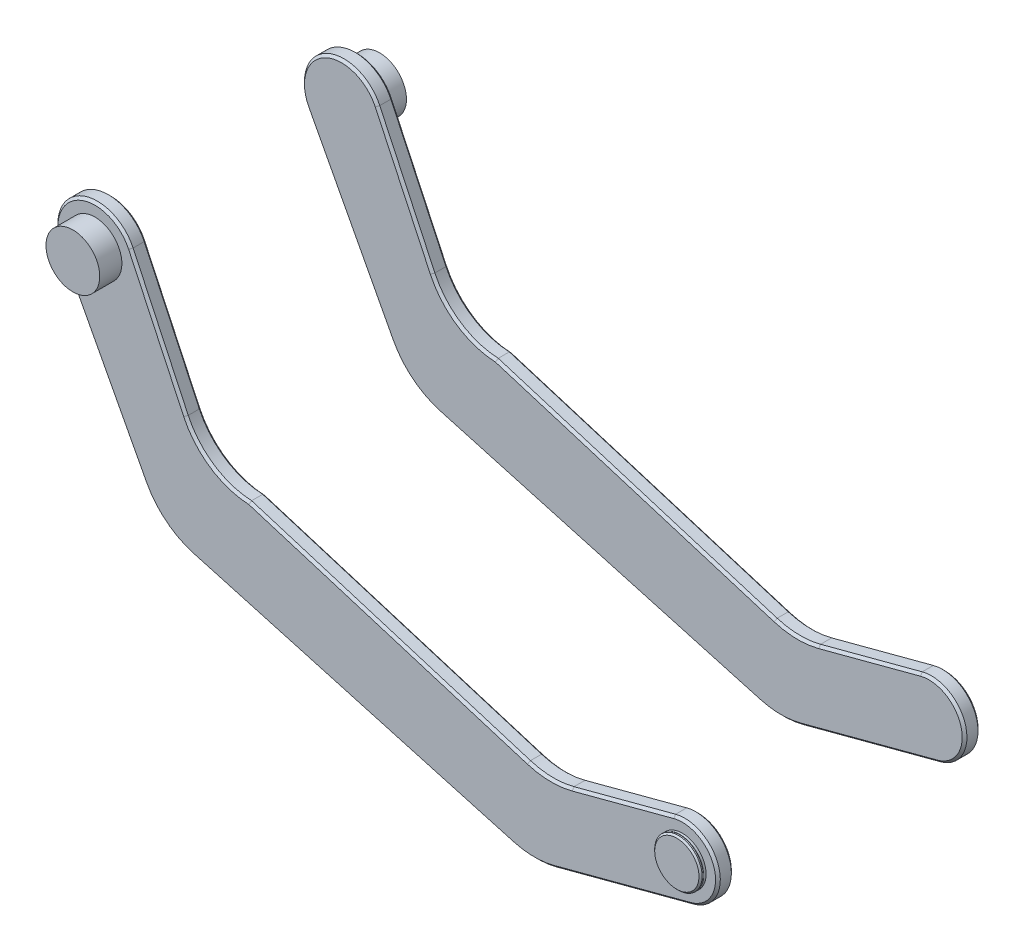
ISO-10303-21;
HEADER;
FILE_DESCRIPTION(('STEP AP214'),'2;1');
FILE_NAME('part.step','',(''),(''),'','','');
FILE_SCHEMA(('AUTOMOTIVE_DESIGN { 1 0 10303 214 1 1 1 1 }'));
ENDSEC;
DATA;
#1=APPLICATION_CONTEXT('core data for automotive mechanical design processes');
#2=APPLICATION_PROTOCOL_DEFINITION('international standard','automotive_design',2000,#1);
#3=PRODUCT_CONTEXT('',#1,'mechanical');
#4=PRODUCT('Part','Part','',(#3));
#5=PRODUCT_RELATED_PRODUCT_CATEGORY('part','',(#4));
#6=PRODUCT_DEFINITION_FORMATION('','',#4);
#7=PRODUCT_DEFINITION_CONTEXT('part definition',#1,'design');
#8=PRODUCT_DEFINITION('design','',#6,#7);
#9=PRODUCT_DEFINITION_SHAPE('','',#8);
#10=(LENGTH_UNIT() NAMED_UNIT(*) SI_UNIT(.MILLI.,.METRE.));
#11=(NAMED_UNIT(*) PLANE_ANGLE_UNIT() SI_UNIT($,.RADIAN.));
#12=(NAMED_UNIT(*) SI_UNIT($,.STERADIAN.) SOLID_ANGLE_UNIT());
#13=UNCERTAINTY_MEASURE_WITH_UNIT(LENGTH_MEASURE(1.E-05),#10,'distance_accuracy_value','');
#14=(GEOMETRIC_REPRESENTATION_CONTEXT(3) GLOBAL_UNCERTAINTY_ASSIGNED_CONTEXT((#13)) GLOBAL_UNIT_ASSIGNED_CONTEXT((#10,
#11,#12)) REPRESENTATION_CONTEXT('',''));
#15=CARTESIAN_POINT('',(0.,0.,0.));
#16=DIRECTION('',(0.,0.,1.));
#17=DIRECTION('',(1.,0.,0.));
#18=AXIS2_PLACEMENT_3D('',#15,#16,#17);
#19=CARTESIAN_POINT('',(329.186841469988,-374.887683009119,84.5));
#20=DIRECTION('',(0.,0.,-1.));
#21=DIRECTION('',(0.430380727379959,0.902647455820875,0.));
#22=AXIS2_PLACEMENT_3D('',#19,#20,#21);
#23=PLANE('',#22);
#24=CARTESIAN_POINT('',(329.186841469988,-374.887683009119,84.5));
#25=DIRECTION('',(0.,0.,-1.));
#26=DIRECTION('',(0.430380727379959,0.902647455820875,0.));
#27=AXIS2_PLACEMENT_3D('',#24,#25,#26);
#28=CIRCLE('',#27,6.5);
#29=CARTESIAN_POINT('',(331.984316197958,-369.020474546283,84.5));
#30=VERTEX_POINT('',#29);
#31=EDGE_CURVE('P0_E20',#30,#30,#28,.F.);
#32=ORIENTED_EDGE('',*,*,#31,.T.);
#33=EDGE_LOOP('',(#32));
#34=FACE_BOUND('',#33,.T.);
#35=CARTESIAN_POINT('',(329.186841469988,-374.887683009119,84.5));
#36=DIRECTION('',(0.,0.,-1.));
#37=DIRECTION('',(0.430380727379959,0.902647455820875,0.));
#38=AXIS2_PLACEMENT_3D('',#35,#36,#37);
#39=CIRCLE('',#38,14.8);
#40=CARTESIAN_POINT('',(335.556476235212,-361.52850066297,84.5));
#41=VERTEX_POINT('',#40);
#42=EDGE_CURVE('P0_E37',#41,#41,#39,.T.);
#43=ORIENTED_EDGE('',*,*,#42,.T.);
#44=EDGE_LOOP('',(#43));
#45=FACE_BOUND('',#44,.T.);
#46=ADVANCED_FACE('P0_F14',(#34,#45),#23,.T.);
#47=CARTESIAN_POINT('',(329.186841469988,-374.887683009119,86.5));
#48=DIRECTION('',(0.,0.,1.));
#49=DIRECTION('',(-0.430380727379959,-0.902647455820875,0.));
#50=AXIS2_PLACEMENT_3D('',#47,#48,#49);
#51=CYLINDRICAL_SURFACE('',#50,15.);
#52=CARTESIAN_POINT('',(329.186841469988,-374.887683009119,85.5));
#53=DIRECTION('',(0.,0.,-1.));
#54=DIRECTION('',(0.430380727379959,0.902647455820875,0.));
#55=AXIS2_PLACEMENT_3D('',#52,#53,#54);
#56=CIRCLE('',#55,15.);
#57=CARTESIAN_POINT('',(335.642552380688,-361.347971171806,85.5));
#58=VERTEX_POINT('',#57);
#59=EDGE_CURVE('P0_E43',#58,#58,#56,.T.);
#60=ORIENTED_EDGE('',*,*,#59,.T.);
#61=EDGE_LOOP('',(#60));
#62=FACE_BOUND('',#61,.T.);
#63=CARTESIAN_POINT('',(329.186841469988,-374.887683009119,84.7));
#64=DIRECTION('',(0.,0.,-1.));
#65=DIRECTION('',(0.430380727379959,0.902647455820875,0.));
#66=AXIS2_PLACEMENT_3D('',#63,#64,#65);
#67=CIRCLE('',#66,15.);
#68=CARTESIAN_POINT('',(335.642552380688,-361.347971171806,84.7));
#69=VERTEX_POINT('',#68);
#70=EDGE_CURVE('P0_E28',#69,#69,#67,.F.);
#71=ORIENTED_EDGE('',*,*,#70,.T.);
#72=EDGE_LOOP('',(#71));
#73=FACE_BOUND('',#72,.T.);
#74=ADVANCED_FACE('P0_F68',(#62,#73),#51,.T.);
#75=CARTESIAN_POINT('',(329.186841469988,-374.887683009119,86.5));
#76=DIRECTION('',(0.,0.,-1.));
#77=DIRECTION('',(0.430380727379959,0.902647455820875,0.));
#78=AXIS2_PLACEMENT_3D('',#75,#76,#77);
#79=PLANE('',#78);
#80=CARTESIAN_POINT('',(329.186841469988,-374.887683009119,86.5));
#81=DIRECTION('',(0.,0.,-1.));
#82=DIRECTION('',(0.430380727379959,0.902647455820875,0.));
#83=AXIS2_PLACEMENT_3D('',#80,#81,#82);
#84=CIRCLE('',#83,14.);
#85=CARTESIAN_POINT('',(335.212171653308,-362.250618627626,86.5));
#86=VERTEX_POINT('',#85);
#87=EDGE_CURVE('P0_E47',#86,#86,#84,.F.);
#88=ORIENTED_EDGE('',*,*,#87,.T.);
#89=EDGE_LOOP('',(#88));
#90=FACE_BOUND('',#89,.T.);
#91=ADVANCED_FACE('P0_F55',(#90),#79,.F.);
#92=CARTESIAN_POINT('',(329.186841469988,-374.887683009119,86.5));
#93=DIRECTION('',(0.,0.,-1.));
#94=DIRECTION('',(0.430380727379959,0.902647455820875,0.));
#95=AXIS2_PLACEMENT_3D('',#92,#93,#94);
#96=CONICAL_SURFACE('',#95,14.,0.785398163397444);
#97=ORIENTED_EDGE('',*,*,#59,.F.);
#98=EDGE_LOOP('',(#97));
#99=FACE_BOUND('',#98,.T.);
#100=ORIENTED_EDGE('',*,*,#87,.F.);
#101=EDGE_LOOP('',(#100));
#102=FACE_BOUND('',#101,.T.);
#103=ADVANCED_FACE('P0_F57',(#99,#102),#96,.T.);
#104=CARTESIAN_POINT('',(329.186841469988,-374.887683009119,84.7));
#105=DIRECTION('',(0.,0.,1.));
#106=DIRECTION('',(-0.430380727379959,-0.902647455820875,0.));
#107=AXIS2_PLACEMENT_3D('',#104,#105,#106);
#108=CONICAL_SURFACE('',#107,15.,0.78539816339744);
#109=ORIENTED_EDGE('',*,*,#70,.F.);
#110=EDGE_LOOP('',(#109));
#111=FACE_BOUND('',#110,.T.);
#112=ORIENTED_EDGE('',*,*,#42,.F.);
#113=EDGE_LOOP('',(#112));
#114=FACE_BOUND('',#113,.T.);
#115=ADVANCED_FACE('P0_F59',(#111,#114),#108,.T.);
#116=CARTESIAN_POINT('',(329.186841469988,-374.887683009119,84.));
#117=DIRECTION('',(0.,0.,-1.));
#118=DIRECTION('',(0.430380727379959,0.902647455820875,0.));
#119=AXIS2_PLACEMENT_3D('',#116,#117,#118);
#120=TOROIDAL_SURFACE('',#119,6.5,0.5);
#121=CARTESIAN_POINT('',(329.186841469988,-374.887683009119,84.));
#122=DIRECTION('',(0.,0.,-1.));
#123=DIRECTION('',(0.430380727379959,0.902647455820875,0.));
#124=AXIS2_PLACEMENT_3D('',#121,#122,#123);
#125=CIRCLE('',#124,6.);
#126=CARTESIAN_POINT('',(331.769125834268,-369.471798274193,84.));
#127=VERTEX_POINT('',#126);
#128=EDGE_CURVE('P0_E10',#127,#127,#125,.T.);
#129=ORIENTED_EDGE('',*,*,#128,.F.);
#130=EDGE_LOOP('',(#129));
#131=FACE_BOUND('',#130,.T.);
#132=ORIENTED_EDGE('',*,*,#31,.F.);
#133=EDGE_LOOP('',(#132));
#134=FACE_BOUND('',#133,.T.);
#135=ADVANCED_FACE('P0_F15',(#131,#134),#120,.F.);
#136=OPEN_SHELL('',(#46,#74,#91,#103,#115,#135));
#137=SHELL_BASED_SURFACE_MODEL('P0_B1',(#136));
#138=CARTESIAN_POINT('',(329.186841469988,-374.887683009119,-84.5));
#139=DIRECTION('',(0.,0.,1.));
#140=DIRECTION('',(-0.430380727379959,-0.902647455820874,0.));
#141=AXIS2_PLACEMENT_3D('',#138,#139,#140);
#142=PLANE('',#141);
#143=CARTESIAN_POINT('',(329.186841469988,-374.887683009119,-84.5));
#144=DIRECTION('',(0.,0.,1.));
#145=DIRECTION('',(-0.430380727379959,-0.902647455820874,0.));
#146=AXIS2_PLACEMENT_3D('',#143,#144,#145);
#147=CIRCLE('',#146,6.5);
#148=CARTESIAN_POINT('',(326.389366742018,-380.754891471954,-84.5));
#149=VERTEX_POINT('',#148);
#150=EDGE_CURVE('P1_E20',#149,#149,#147,.F.);
#151=ORIENTED_EDGE('',*,*,#150,.T.);
#152=EDGE_LOOP('',(#151));
#153=FACE_BOUND('',#152,.T.);
#154=CARTESIAN_POINT('',(329.186841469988,-374.887683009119,-84.5));
#155=DIRECTION('',(0.,0.,1.));
#156=DIRECTION('',(-0.430380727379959,-0.902647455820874,0.));
#157=AXIS2_PLACEMENT_3D('',#154,#155,#156);
#158=CIRCLE('',#157,14.8);
#159=CARTESIAN_POINT('',(322.817206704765,-388.246865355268,-84.5));
#160=VERTEX_POINT('',#159);
#161=EDGE_CURVE('P1_E37',#160,#160,#158,.T.);
#162=ORIENTED_EDGE('',*,*,#161,.T.);
#163=EDGE_LOOP('',(#162));
#164=FACE_BOUND('',#163,.T.);
#165=ADVANCED_FACE('P1_F14',(#153,#164),#142,.T.);
#166=CARTESIAN_POINT('',(329.186841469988,-374.887683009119,-86.5));
#167=DIRECTION('',(0.,0.,-1.));
#168=DIRECTION('',(0.430380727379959,0.902647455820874,0.));
#169=AXIS2_PLACEMENT_3D('',#166,#167,#168);
#170=CYLINDRICAL_SURFACE('',#169,15.);
#171=CARTESIAN_POINT('',(329.186841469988,-374.887683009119,-85.5));
#172=DIRECTION('',(0.,0.,1.));
#173=DIRECTION('',(-0.430380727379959,-0.902647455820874,0.));
#174=AXIS2_PLACEMENT_3D('',#171,#172,#173);
#175=CIRCLE('',#174,15.);
#176=CARTESIAN_POINT('',(322.731130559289,-388.427394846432,-85.5));
#177=VERTEX_POINT('',#176);
#178=EDGE_CURVE('P1_E43',#177,#177,#175,.T.);
#179=ORIENTED_EDGE('',*,*,#178,.T.);
#180=EDGE_LOOP('',(#179));
#181=FACE_BOUND('',#180,.T.);
#182=CARTESIAN_POINT('',(329.186841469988,-374.887683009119,-84.7));
#183=DIRECTION('',(0.,0.,1.));
#184=DIRECTION('',(-0.430380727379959,-0.902647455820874,0.));
#185=AXIS2_PLACEMENT_3D('',#182,#183,#184);
#186=CIRCLE('',#185,15.);
#187=CARTESIAN_POINT('',(322.731130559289,-388.427394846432,-84.7));
#188=VERTEX_POINT('',#187);
#189=EDGE_CURVE('P1_E28',#188,#188,#186,.F.);
#190=ORIENTED_EDGE('',*,*,#189,.T.);
#191=EDGE_LOOP('',(#190));
#192=FACE_BOUND('',#191,.T.);
#193=ADVANCED_FACE('P1_F69',(#181,#192),#170,.T.);
#194=CARTESIAN_POINT('',(329.186841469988,-374.887683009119,-86.5));
#195=DIRECTION('',(0.,0.,1.));
#196=DIRECTION('',(-0.430380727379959,-0.902647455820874,0.));
#197=AXIS2_PLACEMENT_3D('',#194,#195,#196);
#198=PLANE('',#197);
#199=CARTESIAN_POINT('',(329.186841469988,-374.887683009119,-86.5));
#200=DIRECTION('',(0.,0.,1.));
#201=DIRECTION('',(-0.430380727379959,-0.902647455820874,0.));
#202=AXIS2_PLACEMENT_3D('',#199,#200,#201);
#203=CIRCLE('',#202,14.);
#204=CARTESIAN_POINT('',(323.161511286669,-387.524747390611,-86.5));
#205=VERTEX_POINT('',#204);
#206=EDGE_CURVE('P1_E47',#205,#205,#203,.F.);
#207=ORIENTED_EDGE('',*,*,#206,.T.);
#208=EDGE_LOOP('',(#207));
#209=FACE_BOUND('',#208,.T.);
#210=ADVANCED_FACE('P1_F56',(#209),#198,.F.);
#211=CARTESIAN_POINT('',(329.186841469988,-374.887683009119,-86.5));
#212=DIRECTION('',(0.,0.,1.));
#213=DIRECTION('',(-0.430380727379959,-0.902647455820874,0.));
#214=AXIS2_PLACEMENT_3D('',#211,#212,#213);
#215=CONICAL_SURFACE('',#214,14.,0.785398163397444);
#216=ORIENTED_EDGE('',*,*,#178,.F.);
#217=EDGE_LOOP('',(#216));
#218=FACE_BOUND('',#217,.T.);
#219=ORIENTED_EDGE('',*,*,#206,.F.);
#220=EDGE_LOOP('',(#219));
#221=FACE_BOUND('',#220,.T.);
#222=ADVANCED_FACE('P1_F58',(#218,#221),#215,.T.);
#223=CARTESIAN_POINT('',(329.186841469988,-374.887683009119,-84.7));
#224=DIRECTION('',(0.,0.,-1.));
#225=DIRECTION('',(0.430380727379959,0.902647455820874,0.));
#226=AXIS2_PLACEMENT_3D('',#223,#224,#225);
#227=CONICAL_SURFACE('',#226,15.,0.78539816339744);
#228=ORIENTED_EDGE('',*,*,#189,.F.);
#229=EDGE_LOOP('',(#228));
#230=FACE_BOUND('',#229,.T.);
#231=ORIENTED_EDGE('',*,*,#161,.F.);
#232=EDGE_LOOP('',(#231));
#233=FACE_BOUND('',#232,.T.);
#234=ADVANCED_FACE('P1_F60',(#230,#233),#227,.T.);
#235=CARTESIAN_POINT('',(329.186841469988,-374.887683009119,-84.));
#236=DIRECTION('',(0.,0.,1.));
#237=DIRECTION('',(-0.430380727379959,-0.902647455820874,0.));
#238=AXIS2_PLACEMENT_3D('',#235,#236,#237);
#239=TOROIDAL_SURFACE('',#238,6.5,0.5);
#240=CARTESIAN_POINT('',(329.186841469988,-374.887683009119,-84.));
#241=DIRECTION('',(0.,0.,1.));
#242=DIRECTION('',(-0.430380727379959,-0.902647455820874,0.));
#243=AXIS2_PLACEMENT_3D('',#240,#241,#242);
#244=CIRCLE('',#243,6.);
#245=CARTESIAN_POINT('',(326.604557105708,-380.303567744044,-84.));
#246=VERTEX_POINT('',#245);
#247=EDGE_CURVE('P1_E10',#246,#246,#244,.T.);
#248=ORIENTED_EDGE('',*,*,#247,.F.);
#249=EDGE_LOOP('',(#248));
#250=FACE_BOUND('',#249,.T.);
#251=ORIENTED_EDGE('',*,*,#150,.F.);
#252=EDGE_LOOP('',(#251));
#253=FACE_BOUND('',#252,.T.);
#254=ADVANCED_FACE('P1_F15',(#250,#253),#239,.F.);
#255=OPEN_SHELL('',(#165,#193,#210,#222,#234,#254));
#256=SHELL_BASED_SURFACE_MODEL('P1_B1',(#255));
#257=CARTESIAN_POINT('',(329.186841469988,-374.887683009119,-73.));
#258=DIRECTION('',(0.,0.,1.));
#259=DIRECTION('',(-0.966686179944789,0.255964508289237,0.));
#260=AXIS2_PLACEMENT_3D('',#257,#258,#259);
#261=PLANE('',#260);
#262=CARTESIAN_POINT('',(246.327080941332,-321.856917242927,-73.));
#263=DIRECTION('',(0.,0.,1.));
#264=DIRECTION('',(-0.966686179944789,0.255964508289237,0.));
#265=AXIS2_PLACEMENT_3D('',#262,#263,#264);
#266=CIRCLE('',#265,51.5);
#267=CARTESIAN_POINT('',(259.529262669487,-371.635952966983,-73.));
#268=VERTEX_POINT('',#267);
#269=CARTESIAN_POINT('',(231.210598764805,-371.088431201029,-73.));
#270=VERTEX_POINT('',#269);
#271=EDGE_CURVE('P2_E36',#268,#270,#266,.F.);
#272=ORIENTED_EDGE('',*,*,#271,.T.);
#273=DIRECTION('',(-0.955951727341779,0.293523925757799,0.));
#274=VECTOR('',#273,1.);
#275=CARTESIAN_POINT('',(54.7886806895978,-316.918275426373,-73.));
#276=LINE('',#275,#274);
#277=CARTESIAN_POINT('',(54.9707955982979,-316.974193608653,-73.));
#278=VERTEX_POINT('',#277);
#279=EDGE_CURVE('P2_E24',#270,#278,#276,.T.);
#280=ORIENTED_EDGE('',*,*,#279,.T.);
#281=CARTESIAN_POINT('',(57.2382107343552,-269.027777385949,-73.));
#282=DIRECTION('',(0.,0.,1.));
#283=DIRECTION('',(-0.966686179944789,0.255964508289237,0.));
#284=AXIS2_PLACEMENT_3D('',#281,#282,#283);
#285=CIRCLE('',#284,48.);
#286=CARTESIAN_POINT('',(13.7880326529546,-289.425866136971,-73.));
#287=VERTEX_POINT('',#286);
#288=EDGE_CURVE('P2_E392',#278,#287,#285,.F.);
#289=ORIENTED_EDGE('',*,*,#288,.T.);
#290=DIRECTION('',(-0.424960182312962,0.905212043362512,0.));
#291=VECTOR('',#290,1.);
#292=CARTESIAN_POINT('',(-21.0697692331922,-215.174904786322,-73.));
#293=LINE('',#292,#291);
#294=CARTESIAN_POINT('',(-21.0697692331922,-215.174904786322,-73.));
#295=VERTEX_POINT('',#294);
#296=EDGE_CURVE('P2_E386',#287,#295,#293,.T.);
#297=ORIENTED_EDGE('',*,*,#296,.T.);
#298=CARTESIAN_POINT('',(-42.3422522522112,-225.161469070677,-73.));
#299=DIRECTION('',(0.,0.,1.));
#300=DIRECTION('',(-0.966686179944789,0.255964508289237,0.));
#301=AXIS2_PLACEMENT_3D('',#298,#299,#300);
#302=CIRCLE('',#301,23.5);
#303=CARTESIAN_POINT('',(-63.1133930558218,-236.152816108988,-73.));
#304=VERTEX_POINT('',#303);
#305=EDGE_CURVE('P2_E380',#295,#304,#302,.T.);
#306=ORIENTED_EDGE('',*,*,#305,.T.);
#307=DIRECTION('',(0.46771689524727,-0.883878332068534,0.));
#308=VECTOR('',#307,1.);
#309=CARTESIAN_POINT('',(80.0595148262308,-506.716980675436,-73.));
#310=LINE('',#309,#308);
#311=CARTESIAN_POINT('',(-9.67081294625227,-337.147112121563,-73.));
#312=VERTEX_POINT('',#311);
#313=EDGE_CURVE('P2_E374',#304,#312,#310,.T.);
#314=ORIENTED_EDGE('',*,*,#313,.T.);
#315=CARTESIAN_POINT('',(33.1972861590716,-314.46284270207,-73.));
#316=DIRECTION('',(0.,0.,1.));
#317=DIRECTION('',(-0.966686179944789,0.255964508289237,0.));
#318=AXIS2_PLACEMENT_3D('',#315,#316,#317);
#319=CIRCLE('',#318,48.5);
#320=CARTESIAN_POINT('',(20.0994218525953,-361.160765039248,-73.));
#321=VERTEX_POINT('',#320);
#322=EDGE_CURVE('P2_E377',#312,#321,#319,.T.);
#323=ORIENTED_EDGE('',*,*,#322,.T.);
#324=DIRECTION('',(0.962843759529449,-0.270059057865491,0.));
#325=VECTOR('',#324,1.);
#326=CARTESIAN_POINT('',(222.547509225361,-417.943539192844,-73.));
#327=LINE('',#326,#325);
#328=CARTESIAN_POINT('',(222.547509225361,-417.943539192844,-73.));
#329=VERTEX_POINT('',#328);
#330=EDGE_CURVE('P2_E383',#321,#329,#327,.T.);
#331=ORIENTED_EDGE('',*,*,#330,.T.);
#332=CARTESIAN_POINT('',(235.645373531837,-371.245616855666,-73.));
#333=DIRECTION('',(0.,0.,1.));
#334=DIRECTION('',(-0.966686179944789,0.255964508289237,0.));
#335=AXIS2_PLACEMENT_3D('',#332,#333,#334);
#336=CIRCLE('',#335,48.5);
#337=CARTESIAN_POINT('',(248.078496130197,-418.124902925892,-73.));
#338=VERTEX_POINT('',#337);
#339=EDGE_CURVE('P2_E389',#329,#338,#336,.T.);
#340=ORIENTED_EDGE('',*,*,#339,.T.);
#341=DIRECTION('',(0.966583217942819,0.256353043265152,0.));
#342=VECTOR('',#341,1.);
#343=CARTESIAN_POINT('',(334.570255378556,-395.185930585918,-73.));
#344=LINE('',#343,#342);
#345=CARTESIAN_POINT('',(334.570255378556,-395.185930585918,-73.));
#346=VERTEX_POINT('',#345);
#347=EDGE_CURVE('P2_E395',#338,#346,#344,.T.);
#348=ORIENTED_EDGE('',*,*,#347,.T.);
#349=CARTESIAN_POINT('',(329.186841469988,-374.887683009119,-73.));
#350=DIRECTION('',(0.,0.,1.));
#351=DIRECTION('',(-0.966686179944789,0.255964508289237,0.));
#352=AXIS2_PLACEMENT_3D('',#349,#350,#351);
#353=CIRCLE('',#352,21.);
#354=CARTESIAN_POINT('',(323.80342756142,-354.58943543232,-73.));
#355=VERTEX_POINT('',#354);
#356=EDGE_CURVE('P2_E398',#346,#355,#353,.T.);
#357=ORIENTED_EDGE('',*,*,#356,.T.);
#358=DIRECTION('',(-0.966583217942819,-0.256353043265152,0.));
#359=VECTOR('',#358,1.);
#360=CARTESIAN_POINT('',(323.80342756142,-354.58943543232,-73.));
#361=LINE('',#360,#359);
#362=EDGE_CURVE('P2_E43',#355,#268,#361,.T.);
#363=ORIENTED_EDGE('',*,*,#362,.T.);
#364=EDGE_LOOP('',(#272,#280,#289,#297,#306,#314,#323,#331,#340,#348,#357,#363));
#365=FACE_BOUND('',#364,.T.);
#366=ADVANCED_FACE('P2_F16',(#365),#261,.T.);
#367=CARTESIAN_POINT('',(24.9415670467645,-478.856177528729,-83.));
#368=DIRECTION('',(0.256353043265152,-0.966583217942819,0.));
#369=DIRECTION('',(0.966583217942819,0.256353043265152,0.));
#370=AXIS2_PLACEMENT_3D('',#367,#368,#369);
#371=PLANE('',#370);
#372=DIRECTION('',(0.,0.,1.));
#373=VECTOR('',#372,1.);
#374=CARTESIAN_POINT('',(248.463025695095,-419.574777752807,-83.));
#375=LINE('',#374,#373);
#376=CARTESIAN_POINT('',(248.463025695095,-419.574777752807,-74.5));
#377=VERTEX_POINT('',#376);
#378=CARTESIAN_POINT('',(248.463025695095,-419.574777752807,-81.5));
#379=VERTEX_POINT('',#378);
#380=EDGE_CURVE('P2_E268',#377,#379,#375,.F.);
#381=ORIENTED_EDGE('',*,*,#380,.T.);
#382=DIRECTION('',(0.966583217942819,0.256353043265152,0.));
#383=VECTOR('',#382,1.);
#384=CARTESIAN_POINT('',(334.954784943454,-396.635805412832,-81.5));
#385=LINE('',#384,#383);
#386=CARTESIAN_POINT('',(334.954784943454,-396.635805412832,-81.5));
#387=VERTEX_POINT('',#386);
#388=EDGE_CURVE('P2_E330',#379,#387,#385,.T.);
#389=ORIENTED_EDGE('',*,*,#388,.T.);
#390=DIRECTION('',(0.,0.,1.));
#391=VECTOR('',#390,1.);
#392=CARTESIAN_POINT('',(334.954784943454,-396.635805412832,-83.));
#393=LINE('',#392,#391);
#394=CARTESIAN_POINT('',(334.954784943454,-396.635805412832,-74.5));
#395=VERTEX_POINT('',#394);
#396=EDGE_CURVE('P2_E605',#387,#395,#393,.T.);
#397=ORIENTED_EDGE('',*,*,#396,.T.);
#398=DIRECTION('',(-0.966583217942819,-0.256353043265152,0.));
#399=VECTOR('',#398,1.);
#400=CARTESIAN_POINT('',(24.9415670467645,-478.856177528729,-74.5));
#401=LINE('',#400,#399);
#402=EDGE_CURVE('P2_E327',#395,#377,#401,.T.);
#403=ORIENTED_EDGE('',*,*,#402,.T.);
#404=EDGE_LOOP('',(#381,#389,#397,#403));
#405=FACE_BOUND('',#404,.T.);
#406=ADVANCED_FACE('P2_F572',(#405),#371,.T.);
#407=CARTESIAN_POINT('',(329.186841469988,-374.887683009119,-83.));
#408=DIRECTION('',(0.,0.,1.));
#409=DIRECTION('',(-0.966686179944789,0.255964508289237,0.));
#410=AXIS2_PLACEMENT_3D('',#407,#408,#409);
#411=CYLINDRICAL_SURFACE('',#410,22.5);
#412=ORIENTED_EDGE('',*,*,#396,.F.);
#413=CARTESIAN_POINT('',(329.186841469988,-374.887683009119,-81.5));
#414=DIRECTION('',(0.,0.,1.));
#415=DIRECTION('',(-0.966686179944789,0.255964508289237,0.));
#416=AXIS2_PLACEMENT_3D('',#413,#414,#415);
#417=CIRCLE('',#416,22.5);
#418=CARTESIAN_POINT('',(323.418897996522,-353.139560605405,-81.5));
#419=VERTEX_POINT('',#418);
#420=EDGE_CURVE('P2_E324',#387,#419,#417,.T.);
#421=ORIENTED_EDGE('',*,*,#420,.T.);
#422=DIRECTION('',(0.,0.,1.));
#423=VECTOR('',#422,1.);
#424=CARTESIAN_POINT('',(323.418897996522,-353.139560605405,-83.));
#425=LINE('',#424,#423);
#426=CARTESIAN_POINT('',(323.418897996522,-353.139560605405,-74.5));
#427=VERTEX_POINT('',#426);
#428=EDGE_CURVE('P2_E603',#419,#427,#425,.T.);
#429=ORIENTED_EDGE('',*,*,#428,.T.);
#430=CARTESIAN_POINT('',(329.186841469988,-374.887683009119,-74.5));
#431=DIRECTION('',(0.,0.,1.));
#432=DIRECTION('',(-0.966686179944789,0.255964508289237,0.));
#433=AXIS2_PLACEMENT_3D('',#430,#431,#432);
#434=CIRCLE('',#433,22.5);
#435=EDGE_CURVE('P2_E321',#427,#395,#434,.F.);
#436=ORIENTED_EDGE('',*,*,#435,.T.);
#437=EDGE_LOOP('',(#412,#421,#429,#436));
#438=FACE_BOUND('',#437,.T.);
#439=ADVANCED_FACE('P2_F602',(#438),#411,.T.);
#440=CARTESIAN_POINT('',(13.4056800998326,-435.359932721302,-83.));
#441=DIRECTION('',(-0.256353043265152,0.966583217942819,0.));
#442=DIRECTION('',(-0.966583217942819,-0.256353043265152,0.));
#443=AXIS2_PLACEMENT_3D('',#440,#441,#442);
#444=PLANE('',#443);
#445=ORIENTED_EDGE('',*,*,#428,.F.);
#446=DIRECTION('',(-0.966583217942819,-0.256353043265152,0.));
#447=VECTOR('',#446,1.);
#448=CARTESIAN_POINT('',(259.144733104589,-370.186078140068,-81.5));
#449=LINE('',#448,#447);
#450=CARTESIAN_POINT('',(259.144733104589,-370.186078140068,-81.5));
#451=VERTEX_POINT('',#450);
#452=EDGE_CURVE('P2_E318',#419,#451,#449,.T.);
#453=ORIENTED_EDGE('',*,*,#452,.T.);
#454=DIRECTION('',(0.,0.,1.));
#455=VECTOR('',#454,1.);
#456=CARTESIAN_POINT('',(259.144733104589,-370.186078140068,-83.));
#457=LINE('',#456,#455);
#458=CARTESIAN_POINT('',(259.144733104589,-370.186078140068,-74.5));
#459=VERTEX_POINT('',#458);
#460=EDGE_CURVE('P2_E560',#451,#459,#457,.T.);
#461=ORIENTED_EDGE('',*,*,#460,.T.);
#462=DIRECTION('',(0.966583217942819,0.256353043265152,0.));
#463=VECTOR('',#462,1.);
#464=CARTESIAN_POINT('',(13.4056800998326,-435.359932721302,-74.5));
#465=LINE('',#464,#463);
#466=EDGE_CURVE('P2_E315',#459,#427,#465,.T.);
#467=ORIENTED_EDGE('',*,*,#466,.T.);
#468=EDGE_LOOP('',(#445,#453,#461,#467));
#469=FACE_BOUND('',#468,.T.);
#470=ADVANCED_FACE('P2_F607',(#469),#444,.T.);
#471=CARTESIAN_POINT('',(-59.2799989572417,-280.324495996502,-83.));
#472=DIRECTION('',(-0.293523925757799,-0.955951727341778,0.));
#473=DIRECTION('',(0.955951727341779,-0.293523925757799,0.));
#474=AXIS2_PLACEMENT_3D('',#471,#472,#473);
#475=PLANE('',#474);
#476=DIRECTION('',(0.,0.,1.));
#477=VECTOR('',#476,1.);
#478=CARTESIAN_POINT('',(231.650884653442,-369.654503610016,-83.));
#479=LINE('',#478,#477);
#480=CARTESIAN_POINT('',(231.650884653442,-369.654503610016,-74.5));
#481=VERTEX_POINT('',#480);
#482=CARTESIAN_POINT('',(231.650884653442,-369.654503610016,-81.5));
#483=VERTEX_POINT('',#482);
#484=EDGE_CURVE('P2_E551',#481,#483,#479,.F.);
#485=ORIENTED_EDGE('',*,*,#484,.T.);
#486=DIRECTION('',(-0.955951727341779,0.293523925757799,0.));
#487=VECTOR('',#486,1.);
#488=CARTESIAN_POINT('',(-59.2799989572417,-280.324495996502,-81.5));
#489=LINE('',#488,#487);
#490=CARTESIAN_POINT('',(55.2289665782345,-315.48434783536,-81.5));
#491=VERTEX_POINT('',#490);
#492=EDGE_CURVE('P2_E305',#483,#491,#489,.T.);
#493=ORIENTED_EDGE('',*,*,#492,.T.);
#494=DIRECTION('',(0.,0.,1.));
#495=VECTOR('',#494,1.);
#496=CARTESIAN_POINT('',(55.2289665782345,-315.48434783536,-83.));
#497=LINE('',#496,#495);
#498=CARTESIAN_POINT('',(55.2289665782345,-315.48434783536,-74.5));
#499=VERTEX_POINT('',#498);
#500=EDGE_CURVE('P2_E612',#491,#499,#497,.T.);
#501=ORIENTED_EDGE('',*,*,#500,.T.);
#502=DIRECTION('',(0.955951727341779,-0.293523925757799,0.));
#503=VECTOR('',#502,1.);
#504=CARTESIAN_POINT('',(231.650884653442,-369.654503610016,-74.5));
#505=LINE('',#504,#503);
#506=EDGE_CURVE('P2_E301',#499,#481,#505,.T.);
#507=ORIENTED_EDGE('',*,*,#506,.T.);
#508=EDGE_LOOP('',(#485,#493,#501,#507));
#509=FACE_BOUND('',#508,.T.);
#510=ADVANCED_FACE('P2_F661',(#509),#475,.F.);
#511=CARTESIAN_POINT('',(57.2382107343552,-269.027777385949,-83.));
#512=DIRECTION('',(0.,0.,1.));
#513=DIRECTION('',(-0.966686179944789,0.255964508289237,0.));
#514=AXIS2_PLACEMENT_3D('',#511,#512,#513);
#515=CYLINDRICAL_SURFACE('',#514,46.5);
#516=ORIENTED_EDGE('',*,*,#500,.F.);
#517=CARTESIAN_POINT('',(57.2382107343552,-269.027777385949,-81.5));
#518=DIRECTION('',(0.,0.,1.));
#519=DIRECTION('',(-0.966686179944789,0.255964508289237,0.));
#520=AXIS2_PLACEMENT_3D('',#517,#518,#519);
#521=CIRCLE('',#520,46.5);
#522=CARTESIAN_POINT('',(15.1458507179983,-288.788425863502,-81.5));
#523=VERTEX_POINT('',#522);
#524=EDGE_CURVE('P2_E371',#491,#523,#521,.F.);
#525=ORIENTED_EDGE('',*,*,#524,.T.);
#526=DIRECTION('',(0.,0.,1.));
#527=VECTOR('',#526,1.);
#528=CARTESIAN_POINT('',(15.1458507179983,-288.788425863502,-83.));
#529=LINE('',#528,#527);
#530=CARTESIAN_POINT('',(15.1458507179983,-288.788425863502,-74.5));
#531=VERTEX_POINT('',#530);
#532=EDGE_CURVE('P2_E621',#523,#531,#529,.T.);
#533=ORIENTED_EDGE('',*,*,#532,.T.);
#534=CARTESIAN_POINT('',(57.2382107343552,-269.027777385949,-74.5));
#535=DIRECTION('',(0.,0.,1.));
#536=DIRECTION('',(-0.966686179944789,0.255964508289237,0.));
#537=AXIS2_PLACEMENT_3D('',#534,#535,#536);
#538=CIRCLE('',#537,46.5);
#539=EDGE_CURVE('P2_E368',#531,#499,#538,.T.);
#540=ORIENTED_EDGE('',*,*,#539,.T.);
#541=EDGE_LOOP('',(#516,#525,#533,#540));
#542=FACE_BOUND('',#541,.T.);
#543=ADVANCED_FACE('P2_F658',(#542),#515,.F.);
#544=CARTESIAN_POINT('',(-19.7119511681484,-214.537464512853,-83.));
#545=DIRECTION('',(-0.905212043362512,-0.424960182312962,0.));
#546=DIRECTION('',(0.424960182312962,-0.905212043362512,0.));
#547=AXIS2_PLACEMENT_3D('',#544,#545,#546);
#548=PLANE('',#547);
#549=ORIENTED_EDGE('',*,*,#532,.F.);
#550=DIRECTION('',(-0.424960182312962,0.905212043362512,0.));
#551=VECTOR('',#550,1.);
#552=CARTESIAN_POINT('',(-19.7119511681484,-214.537464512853,-81.5));
#553=LINE('',#552,#551);
#554=CARTESIAN_POINT('',(-19.7119511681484,-214.537464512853,-81.5));
#555=VERTEX_POINT('',#554);
#556=EDGE_CURVE('P2_E248',#523,#555,#553,.T.);
#557=ORIENTED_EDGE('',*,*,#556,.T.);
#558=DIRECTION('',(0.,0.,1.));
#559=VECTOR('',#558,1.);
#560=CARTESIAN_POINT('',(-19.7119511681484,-214.537464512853,-83.));
#561=LINE('',#560,#559);
#562=CARTESIAN_POINT('',(-19.7119511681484,-214.537464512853,-74.5));
#563=VERTEX_POINT('',#562);
#564=EDGE_CURVE('P2_E626',#555,#563,#561,.T.);
#565=ORIENTED_EDGE('',*,*,#564,.T.);
#566=DIRECTION('',(0.424960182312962,-0.905212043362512,0.));
#567=VECTOR('',#566,1.);
#568=CARTESIAN_POINT('',(15.1458507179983,-288.788425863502,-74.5));
#569=LINE('',#568,#567);
#570=EDGE_CURVE('P2_E363',#563,#531,#569,.T.);
#571=ORIENTED_EDGE('',*,*,#570,.T.);
#572=EDGE_LOOP('',(#549,#557,#565,#571));
#573=FACE_BOUND('',#572,.T.);
#574=ADVANCED_FACE('P2_F724',(#573),#548,.F.);
#575=CARTESIAN_POINT('',(-42.3422522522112,-225.161469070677,-83.));
#576=DIRECTION('',(0.,0.,1.));
#577=DIRECTION('',(-0.966686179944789,0.255964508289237,0.));
#578=AXIS2_PLACEMENT_3D('',#575,#576,#577);
#579=CYLINDRICAL_SURFACE('',#578,25.);
#580=ORIENTED_EDGE('',*,*,#564,.F.);
#581=CARTESIAN_POINT('',(-42.3422522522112,-225.161469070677,-81.5));
#582=DIRECTION('',(0.,0.,1.));
#583=DIRECTION('',(-0.966686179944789,0.255964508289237,0.));
#584=AXIS2_PLACEMENT_3D('',#581,#582,#583);
#585=CIRCLE('',#584,25.);
#586=CARTESIAN_POINT('',(-64.4392105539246,-236.854391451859,-81.5));
#587=VERTEX_POINT('',#586);
#588=EDGE_CURVE('P2_E360',#555,#587,#585,.T.);
#589=ORIENTED_EDGE('',*,*,#588,.T.);
#590=DIRECTION('',(0.,0.,1.));
#591=VECTOR('',#590,1.);
#592=CARTESIAN_POINT('',(-64.4392105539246,-236.854391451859,-83.));
#593=LINE('',#592,#591);
#594=CARTESIAN_POINT('',(-64.4392105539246,-236.854391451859,-74.5));
#595=VERTEX_POINT('',#594);
#596=EDGE_CURVE('P2_E631',#587,#595,#593,.T.);
#597=ORIENTED_EDGE('',*,*,#596,.T.);
#598=CARTESIAN_POINT('',(-42.3422522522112,-225.161469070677,-74.5));
#599=DIRECTION('',(0.,0.,1.));
#600=DIRECTION('',(-0.966686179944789,0.255964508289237,0.));
#601=AXIS2_PLACEMENT_3D('',#598,#599,#600);
#602=CIRCLE('',#601,25.);
#603=EDGE_CURVE('P2_E357',#595,#563,#602,.F.);
#604=ORIENTED_EDGE('',*,*,#603,.T.);
#605=EDGE_LOOP('',(#580,#589,#597,#604));
#606=FACE_BOUND('',#605,.T.);
#607=ADVANCED_FACE('P2_F727',(#606),#579,.T.);
#608=CARTESIAN_POINT('',(-64.4392105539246,-236.854391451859,-83.));
#609=DIRECTION('',(-0.883878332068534,-0.46771689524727,0.));
#610=DIRECTION('',(0.46771689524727,-0.883878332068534,0.));
#611=AXIS2_PLACEMENT_3D('',#608,#609,#610);
#612=PLANE('',#611);
#613=ORIENTED_EDGE('',*,*,#596,.F.);
#614=DIRECTION('',(0.46771689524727,-0.883878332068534,0.));
#615=VECTOR('',#614,1.);
#616=CARTESIAN_POINT('',(-10.9966304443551,-337.848687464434,-81.5));
#617=LINE('',#616,#615);
#618=CARTESIAN_POINT('',(-10.9966304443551,-337.848687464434,-81.5));
#619=VERTEX_POINT('',#618);
#620=EDGE_CURVE('P2_E354',#587,#619,#617,.T.);
#621=ORIENTED_EDGE('',*,*,#620,.T.);
#622=DIRECTION('',(0.,0.,1.));
#623=VECTOR('',#622,1.);
#624=CARTESIAN_POINT('',(-10.9966304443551,-337.848687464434,-73.));
#625=LINE('',#624,#623);
#626=CARTESIAN_POINT('',(-10.9966304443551,-337.848687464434,-74.5));
#627=VERTEX_POINT('',#626);
#628=EDGE_CURVE('P2_E259',#619,#627,#625,.T.);
#629=ORIENTED_EDGE('',*,*,#628,.T.);
#630=DIRECTION('',(-0.46771689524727,0.883878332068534,0.));
#631=VECTOR('',#630,1.);
#632=CARTESIAN_POINT('',(-64.4392105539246,-236.854391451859,-74.5));
#633=LINE('',#632,#631);
#634=EDGE_CURVE('P2_E351',#627,#595,#633,.T.);
#635=ORIENTED_EDGE('',*,*,#634,.T.);
#636=EDGE_LOOP('',(#613,#621,#629,#635));
#637=FACE_BOUND('',#636,.T.);
#638=ADVANCED_FACE('P2_F731',(#637),#612,.T.);
#639=CARTESIAN_POINT('',(-73.5565244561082,-336.449968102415,-83.));
#640=DIRECTION('',(0.270059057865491,0.962843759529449,0.));
#641=DIRECTION('',(-0.962843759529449,0.270059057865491,0.));
#642=AXIS2_PLACEMENT_3D('',#639,#640,#641);
#643=PLANE('',#642);
#644=DIRECTION('',(0.,0.,1.));
#645=VECTOR('',#644,1.);
#646=CARTESIAN_POINT('',(19.6943332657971,-362.605030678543,-83.));
#647=LINE('',#646,#645);
#648=CARTESIAN_POINT('',(19.6943332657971,-362.605030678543,-74.5));
#649=VERTEX_POINT('',#648);
#650=CARTESIAN_POINT('',(19.6943332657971,-362.605030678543,-81.5));
#651=VERTEX_POINT('',#650);
#652=EDGE_CURVE('P2_E543',#649,#651,#647,.F.);
#653=ORIENTED_EDGE('',*,*,#652,.T.);
#654=DIRECTION('',(0.962843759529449,-0.270059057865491,0.));
#655=VECTOR('',#654,1.);
#656=CARTESIAN_POINT('',(-73.5565244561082,-336.449968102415,-81.5));
#657=LINE('',#656,#655);
#658=CARTESIAN_POINT('',(222.142420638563,-419.387804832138,-81.5));
#659=VERTEX_POINT('',#658);
#660=EDGE_CURVE('P2_E342',#651,#659,#657,.T.);
#661=ORIENTED_EDGE('',*,*,#660,.T.);
#662=DIRECTION('',(0.,0.,1.));
#663=VECTOR('',#662,1.);
#664=CARTESIAN_POINT('',(222.142420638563,-419.387804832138,-73.));
#665=LINE('',#664,#663);
#666=CARTESIAN_POINT('',(222.142420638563,-419.387804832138,-74.5));
#667=VERTEX_POINT('',#666);
#668=EDGE_CURVE('P2_E546',#659,#667,#665,.T.);
#669=ORIENTED_EDGE('',*,*,#668,.T.);
#670=DIRECTION('',(-0.962843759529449,0.270059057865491,0.));
#671=VECTOR('',#670,1.);
#672=CARTESIAN_POINT('',(19.6943332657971,-362.605030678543,-74.5));
#673=LINE('',#672,#671);
#674=EDGE_CURVE('P2_E339',#667,#649,#673,.T.);
#675=ORIENTED_EDGE('',*,*,#674,.T.);
#676=EDGE_LOOP('',(#653,#661,#669,#675));
#677=FACE_BOUND('',#676,.T.);
#678=ADVANCED_FACE('P2_F542',(#677),#643,.F.);
#679=CARTESIAN_POINT('',(-42.3422522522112,-225.161469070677,-83.));
#680=DIRECTION('',(0.,0.,1.));
#681=DIRECTION('',(-0.966686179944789,0.255964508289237,0.));
#682=AXIS2_PLACEMENT_3D('',#679,#680,#681);
#683=PLANE('',#682);
#684=CARTESIAN_POINT('',(-42.3422522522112,-225.161469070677,-83.));
#685=DIRECTION('',(0.,0.,1.));
#686=DIRECTION('',(1.,0.,0.));
#687=AXIS2_PLACEMENT_3D('',#684,#685,#686);
#688=CIRCLE('',#687,17.);
#689=CARTESIAN_POINT('',(-25.3422522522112,-225.161469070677,-83.));
#690=VERTEX_POINT('',#689);
#691=EDGE_CURVE('P2_E11',#690,#690,#688,.F.);
#692=ORIENTED_EDGE('',*,*,#691,.F.);
#693=EDGE_LOOP('',(#692));
#694=FACE_BOUND('',#693,.T.);
#695=CARTESIAN_POINT('',(57.2382107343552,-269.027777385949,-83.));
#696=DIRECTION('',(0.,0.,1.));
#697=DIRECTION('',(-0.966686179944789,0.255964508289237,0.));
#698=AXIS2_PLACEMENT_3D('',#695,#696,#697);
#699=CIRCLE('',#698,48.);
#700=CARTESIAN_POINT('',(13.7880326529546,-289.425866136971,-83.));
#701=VERTEX_POINT('',#700);
#702=CARTESIAN_POINT('',(54.9707955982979,-316.974193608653,-83.));
#703=VERTEX_POINT('',#702);
#704=EDGE_CURVE('P2_E235',#701,#703,#699,.T.);
#705=ORIENTED_EDGE('',*,*,#704,.T.);
#706=DIRECTION('',(0.955951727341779,-0.293523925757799,0.));
#707=VECTOR('',#706,1.);
#708=CARTESIAN_POINT('',(-59.7202848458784,-281.758423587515,-83.));
#709=LINE('',#708,#707);
#710=CARTESIAN_POINT('',(231.210598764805,-371.088431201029,-83.));
#711=VERTEX_POINT('',#710);
#712=EDGE_CURVE('P2_E298',#703,#711,#709,.T.);
#713=ORIENTED_EDGE('',*,*,#712,.T.);
#714=CARTESIAN_POINT('',(246.327080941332,-321.856917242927,-83.));
#715=DIRECTION('',(0.,0.,1.));
#716=DIRECTION('',(-0.966686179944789,0.255964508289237,0.));
#717=AXIS2_PLACEMENT_3D('',#714,#715,#716);
#718=CIRCLE('',#717,51.5);
#719=CARTESIAN_POINT('',(259.529262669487,-371.635952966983,-83.));
#720=VERTEX_POINT('',#719);
#721=EDGE_CURVE('P2_E295',#711,#720,#718,.T.);
#722=ORIENTED_EDGE('',*,*,#721,.T.);
#723=DIRECTION('',(0.966583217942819,0.256353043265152,0.));
#724=VECTOR('',#723,1.);
#725=CARTESIAN_POINT('',(323.80342756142,-354.58943543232,-83.));
#726=LINE('',#725,#724);
#727=CARTESIAN_POINT('',(323.80342756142,-354.58943543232,-83.));
#728=VERTEX_POINT('',#727);
#729=EDGE_CURVE('P2_E292',#720,#728,#726,.T.);
#730=ORIENTED_EDGE('',*,*,#729,.T.);
#731=CARTESIAN_POINT('',(329.186841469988,-374.887683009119,-83.));
#732=DIRECTION('',(0.,0.,1.));
#733=DIRECTION('',(-0.966686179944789,0.255964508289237,0.));
#734=AXIS2_PLACEMENT_3D('',#731,#732,#733);
#735=CIRCLE('',#734,21.);
#736=CARTESIAN_POINT('',(334.570255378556,-395.185930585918,-83.));
#737=VERTEX_POINT('',#736);
#738=EDGE_CURVE('P2_E289',#728,#737,#735,.F.);
#739=ORIENTED_EDGE('',*,*,#738,.T.);
#740=DIRECTION('',(-0.966583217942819,-0.256353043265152,0.));
#741=VECTOR('',#740,1.);
#742=CARTESIAN_POINT('',(248.078496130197,-418.124902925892,-83.));
#743=LINE('',#742,#741);
#744=CARTESIAN_POINT('',(248.078496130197,-418.124902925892,-83.));
#745=VERTEX_POINT('',#744);
#746=EDGE_CURVE('P2_E286',#737,#745,#743,.T.);
#747=ORIENTED_EDGE('',*,*,#746,.T.);
#748=CARTESIAN_POINT('',(235.645373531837,-371.245616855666,-83.));
#749=DIRECTION('',(0.,0.,1.));
#750=DIRECTION('',(-0.966686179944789,0.255964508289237,0.));
#751=AXIS2_PLACEMENT_3D('',#748,#749,#750);
#752=CIRCLE('',#751,48.5);
#753=CARTESIAN_POINT('',(222.547509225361,-417.943539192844,-83.));
#754=VERTEX_POINT('',#753);
#755=EDGE_CURVE('P2_E283',#745,#754,#752,.F.);
#756=ORIENTED_EDGE('',*,*,#755,.T.);
#757=DIRECTION('',(-0.962843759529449,0.270059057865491,0.));
#758=VECTOR('',#757,1.);
#759=CARTESIAN_POINT('',(-73.15143586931,-335.005702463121,-83.));
#760=LINE('',#759,#758);
#761=CARTESIAN_POINT('',(20.0994218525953,-361.160765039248,-83.));
#762=VERTEX_POINT('',#761);
#763=EDGE_CURVE('P2_E280',#754,#762,#760,.T.);
#764=ORIENTED_EDGE('',*,*,#763,.T.);
#765=CARTESIAN_POINT('',(33.1972861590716,-314.46284270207,-83.));
#766=DIRECTION('',(0.,0.,1.));
#767=DIRECTION('',(-0.966686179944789,0.255964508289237,0.));
#768=AXIS2_PLACEMENT_3D('',#765,#766,#767);
#769=CIRCLE('',#768,48.5);
#770=CARTESIAN_POINT('',(-9.6708129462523,-337.147112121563,-83.));
#771=VERTEX_POINT('',#770);
#772=EDGE_CURVE('P2_E277',#762,#771,#769,.F.);
#773=ORIENTED_EDGE('',*,*,#772,.T.);
#774=DIRECTION('',(-0.46771689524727,0.883878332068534,0.));
#775=VECTOR('',#774,1.);
#776=CARTESIAN_POINT('',(-63.1133930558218,-236.152816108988,-83.));
#777=LINE('',#776,#775);
#778=CARTESIAN_POINT('',(-63.1133930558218,-236.152816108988,-83.));
#779=VERTEX_POINT('',#778);
#780=EDGE_CURVE('P2_E274',#771,#779,#777,.T.);
#781=ORIENTED_EDGE('',*,*,#780,.T.);
#782=CARTESIAN_POINT('',(-42.3422522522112,-225.161469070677,-83.));
#783=DIRECTION('',(0.,0.,1.));
#784=DIRECTION('',(-0.966686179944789,0.255964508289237,0.));
#785=AXIS2_PLACEMENT_3D('',#782,#783,#784);
#786=CIRCLE('',#785,23.5);
#787=CARTESIAN_POINT('',(-21.0697692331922,-215.174904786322,-83.));
#788=VERTEX_POINT('',#787);
#789=EDGE_CURVE('P2_E238',#779,#788,#786,.F.);
#790=ORIENTED_EDGE('',*,*,#789,.T.);
#791=DIRECTION('',(0.424960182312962,-0.905212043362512,0.));
#792=VECTOR('',#791,1.);
#793=CARTESIAN_POINT('',(-21.0697692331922,-215.174904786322,-83.));
#794=LINE('',#793,#792);
#795=EDGE_CURVE('P2_E230',#788,#701,#794,.T.);
#796=ORIENTED_EDGE('',*,*,#795,.T.);
#797=EDGE_LOOP('',(#705,#713,#722,#730,#739,#747,#756,#764,#773,#781,#790,#796));
#798=FACE_BOUND('',#797,.T.);
#799=ADVANCED_FACE('P2_F232',(#694,#798),#683,.F.);
#800=CARTESIAN_POINT('',(246.327080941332,-321.856917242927,-83.));
#801=DIRECTION('',(0.,0.,1.));
#802=DIRECTION('',(-0.966686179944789,0.255964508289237,0.));
#803=AXIS2_PLACEMENT_3D('',#800,#801,#802);
#804=CYLINDRICAL_SURFACE('',#803,50.);
#805=ORIENTED_EDGE('',*,*,#460,.F.);
#806=CARTESIAN_POINT('',(246.327080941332,-321.856917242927,-81.5));
#807=DIRECTION('',(0.,0.,1.));
#808=DIRECTION('',(-0.966686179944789,0.255964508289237,0.));
#809=AXIS2_PLACEMENT_3D('',#806,#807,#808);
#810=CIRCLE('',#809,50.);
#811=EDGE_CURVE('P2_E312',#451,#483,#810,.F.);
#812=ORIENTED_EDGE('',*,*,#811,.T.);
#813=ORIENTED_EDGE('',*,*,#484,.F.);
#814=CARTESIAN_POINT('',(246.327080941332,-321.856917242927,-74.5));
#815=DIRECTION('',(0.,0.,1.));
#816=DIRECTION('',(-0.966686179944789,0.255964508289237,0.));
#817=AXIS2_PLACEMENT_3D('',#814,#815,#816);
#818=CIRCLE('',#817,50.);
#819=EDGE_CURVE('P2_E309',#481,#459,#818,.T.);
#820=ORIENTED_EDGE('',*,*,#819,.T.);
#821=EDGE_LOOP('',(#805,#812,#813,#820));
#822=FACE_BOUND('',#821,.T.);
#823=ADVANCED_FACE('P2_F698',(#822),#804,.F.);
#824=CARTESIAN_POINT('',(235.645373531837,-371.245616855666,-83.));
#825=DIRECTION('',(0.,0.,-1.));
#826=DIRECTION('',(0.966686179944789,-0.255964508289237,0.));
#827=AXIS2_PLACEMENT_3D('',#824,#825,#826);
#828=CYLINDRICAL_SURFACE('',#827,50.);
#829=ORIENTED_EDGE('',*,*,#668,.F.);
#830=CARTESIAN_POINT('',(235.645373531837,-371.245616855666,-81.5));
#831=DIRECTION('',(0.,0.,1.));
#832=DIRECTION('',(-0.966686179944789,0.255964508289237,0.));
#833=AXIS2_PLACEMENT_3D('',#830,#831,#832);
#834=CIRCLE('',#833,50.);
#835=EDGE_CURVE('P2_E336',#659,#379,#834,.T.);
#836=ORIENTED_EDGE('',*,*,#835,.T.);
#837=ORIENTED_EDGE('',*,*,#380,.F.);
#838=CARTESIAN_POINT('',(235.645373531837,-371.245616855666,-74.5));
#839=DIRECTION('',(0.,0.,1.));
#840=DIRECTION('',(-0.966686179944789,0.255964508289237,0.));
#841=AXIS2_PLACEMENT_3D('',#838,#839,#840);
#842=CIRCLE('',#841,50.);
#843=EDGE_CURVE('P2_E333',#377,#667,#842,.F.);
#844=ORIENTED_EDGE('',*,*,#843,.T.);
#845=EDGE_LOOP('',(#829,#836,#837,#844));
#846=FACE_BOUND('',#845,.T.);
#847=ADVANCED_FACE('P2_F696',(#846),#828,.T.);
#848=CARTESIAN_POINT('',(33.1972861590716,-314.46284270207,-83.));
#849=DIRECTION('',(0.,0.,-1.));
#850=DIRECTION('',(0.966686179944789,-0.255964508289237,0.));
#851=AXIS2_PLACEMENT_3D('',#848,#849,#850);
#852=CYLINDRICAL_SURFACE('',#851,50.);
#853=ORIENTED_EDGE('',*,*,#628,.F.);
#854=CARTESIAN_POINT('',(33.1972861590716,-314.46284270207,-81.5));
#855=DIRECTION('',(0.,0.,1.));
#856=DIRECTION('',(-0.966686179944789,0.255964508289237,0.));
#857=AXIS2_PLACEMENT_3D('',#854,#855,#856);
#858=CIRCLE('',#857,50.);
#859=EDGE_CURVE('P2_E348',#619,#651,#858,.T.);
#860=ORIENTED_EDGE('',*,*,#859,.T.);
#861=ORIENTED_EDGE('',*,*,#652,.F.);
#862=CARTESIAN_POINT('',(33.1972861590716,-314.46284270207,-74.5));
#863=DIRECTION('',(0.,0.,1.));
#864=DIRECTION('',(-0.966686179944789,0.255964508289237,0.));
#865=AXIS2_PLACEMENT_3D('',#862,#863,#864);
#866=CIRCLE('',#865,50.);
#867=EDGE_CURVE('P2_E345',#649,#627,#866,.F.);
#868=ORIENTED_EDGE('',*,*,#867,.T.);
#869=EDGE_LOOP('',(#853,#860,#861,#868));
#870=FACE_BOUND('',#869,.T.);
#871=ADVANCED_FACE('P2_F463',(#870),#852,.T.);
#872=CARTESIAN_POINT('',(-73.15143586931,-335.005702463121,-83.));
#873=DIRECTION('',(0.190960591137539,0.680833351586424,0.707106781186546));
#874=DIRECTION('',(-0.962843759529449,0.270059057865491,0.));
#875=AXIS2_PLACEMENT_3D('',#872,#873,#874);
#876=PLANE('',#875);
#877=DIRECTION('',(0.190960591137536,0.680833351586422,-0.707106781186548));
#878=VECTOR('',#877,1.);
#879=CARTESIAN_POINT('',(222.142420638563,-419.387804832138,-81.5));
#880=LINE('',#879,#878);
#881=EDGE_CURVE('P2_E682',#659,#754,#880,.T.);
#882=ORIENTED_EDGE('',*,*,#881,.F.);
#883=ORIENTED_EDGE('',*,*,#660,.F.);
#884=DIRECTION('',(-0.190960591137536,-0.680833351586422,0.707106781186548));
#885=VECTOR('',#884,1.);
#886=CARTESIAN_POINT('',(20.0994218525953,-361.160765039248,-83.));
#887=LINE('',#886,#885);
#888=EDGE_CURVE('P2_E485',#762,#651,#887,.T.);
#889=ORIENTED_EDGE('',*,*,#888,.F.);
#890=ORIENTED_EDGE('',*,*,#763,.F.);
#891=EDGE_LOOP('',(#882,#883,#889,#890));
#892=FACE_BOUND('',#891,.T.);
#893=ADVANCED_FACE('P2_F459',(#892),#876,.F.);
#894=CARTESIAN_POINT('',(33.1972861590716,-314.46284270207,-83.));
#895=DIRECTION('',(0.,0.,1.));
#896=DIRECTION('',(-0.966686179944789,0.255964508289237,0.));
#897=AXIS2_PLACEMENT_3D('',#894,#895,#896);
#898=CONICAL_SURFACE('',#897,48.5,0.785398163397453);
#899=ORIENTED_EDGE('',*,*,#888,.T.);
#900=ORIENTED_EDGE('',*,*,#859,.F.);
#901=DIRECTION('',(-0.624996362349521,-0.330725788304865,0.707106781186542));
#902=VECTOR('',#901,1.);
#903=CARTESIAN_POINT('',(-9.67081294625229,-337.147112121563,-83.));
#904=LINE('',#903,#902);
#905=EDGE_CURVE('P2_E585',#771,#619,#904,.T.);
#906=ORIENTED_EDGE('',*,*,#905,.F.);
#907=ORIENTED_EDGE('',*,*,#772,.F.);
#908=EDGE_LOOP('',(#899,#900,#906,#907));
#909=FACE_BOUND('',#908,.T.);
#910=ADVANCED_FACE('P2_F455',(#909),#898,.T.);
#911=CARTESIAN_POINT('',(235.645373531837,-371.245616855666,-83.));
#912=DIRECTION('',(0.,0.,1.));
#913=DIRECTION('',(-0.966686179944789,0.255964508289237,0.));
#914=AXIS2_PLACEMENT_3D('',#911,#912,#913);
#915=CONICAL_SURFACE('',#914,48.5,0.785398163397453);
#916=ORIENTED_EDGE('',*,*,#881,.T.);
#917=ORIENTED_EDGE('',*,*,#755,.F.);
#918=DIRECTION('',(-0.1812689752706,0.683477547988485,-0.707106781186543));
#919=VECTOR('',#918,1.);
#920=CARTESIAN_POINT('',(248.463025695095,-419.574777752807,-81.5));
#921=LINE('',#920,#919);
#922=EDGE_CURVE('P2_E581',#379,#745,#921,.T.);
#923=ORIENTED_EDGE('',*,*,#922,.F.);
#924=ORIENTED_EDGE('',*,*,#835,.F.);
#925=EDGE_LOOP('',(#916,#917,#923,#924));
#926=FACE_BOUND('',#925,.T.);
#927=ADVANCED_FACE('P2_F451',(#926),#915,.T.);
#928=CARTESIAN_POINT('',(-64.4392105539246,-236.854391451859,-81.5));
#929=DIRECTION('',(-0.624996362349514,-0.330725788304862,-0.70710678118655));
#930=DIRECTION('',(-0.46771689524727,0.883878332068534,0.));
#931=AXIS2_PLACEMENT_3D('',#928,#929,#930);
#932=PLANE('',#931);
#933=ORIENTED_EDGE('',*,*,#905,.T.);
#934=ORIENTED_EDGE('',*,*,#620,.F.);
#935=DIRECTION('',(-0.624996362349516,-0.330725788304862,0.707106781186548));
#936=VECTOR('',#935,1.);
#937=CARTESIAN_POINT('',(-63.1133930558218,-236.152816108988,-83.));
#938=LINE('',#937,#936);
#939=EDGE_CURVE('P2_E586',#779,#587,#938,.T.);
#940=ORIENTED_EDGE('',*,*,#939,.F.);
#941=ORIENTED_EDGE('',*,*,#780,.F.);
#942=EDGE_LOOP('',(#933,#934,#940,#941));
#943=FACE_BOUND('',#942,.T.);
#944=ADVANCED_FACE('P2_F447',(#943),#932,.T.);
#945=CARTESIAN_POINT('',(24.9415670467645,-478.856177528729,-81.5));
#946=DIRECTION('',(0.181268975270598,-0.683477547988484,-0.707106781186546));
#947=DIRECTION('',(-0.966583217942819,-0.256353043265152,0.));
#948=AXIS2_PLACEMENT_3D('',#945,#946,#947);
#949=PLANE('',#948);
#950=ORIENTED_EDGE('',*,*,#922,.T.);
#951=ORIENTED_EDGE('',*,*,#746,.F.);
#952=DIRECTION('',(-0.181268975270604,0.683477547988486,-0.707106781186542));
#953=VECTOR('',#952,1.);
#954=CARTESIAN_POINT('',(334.954784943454,-396.635805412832,-81.5));
#955=LINE('',#954,#953);
#956=EDGE_CURVE('P2_E590',#387,#737,#955,.T.);
#957=ORIENTED_EDGE('',*,*,#956,.F.);
#958=ORIENTED_EDGE('',*,*,#388,.F.);
#959=EDGE_LOOP('',(#950,#951,#957,#958));
#960=FACE_BOUND('',#959,.T.);
#961=ADVANCED_FACE('P2_F443',(#960),#949,.T.);
#962=CARTESIAN_POINT('',(-42.3422522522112,-225.161469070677,-81.5));
#963=DIRECTION('',(0.,0.,1.));
#964=DIRECTION('',(-0.966686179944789,0.255964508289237,0.));
#965=AXIS2_PLACEMENT_3D('',#962,#963,#964);
#966=CONICAL_SURFACE('',#965,25.,0.785398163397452);
#967=ORIENTED_EDGE('',*,*,#939,.T.);
#968=ORIENTED_EDGE('',*,*,#588,.F.);
#969=DIRECTION('',(0.640081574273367,0.300492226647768,0.707106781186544));
#970=VECTOR('',#969,1.);
#971=CARTESIAN_POINT('',(-21.0697692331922,-215.174904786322,-83.));
#972=LINE('',#971,#970);
#973=EDGE_CURVE('P2_E594',#788,#555,#972,.T.);
#974=ORIENTED_EDGE('',*,*,#973,.F.);
#975=ORIENTED_EDGE('',*,*,#789,.F.);
#976=EDGE_LOOP('',(#967,#968,#974,#975));
#977=FACE_BOUND('',#976,.T.);
#978=ADVANCED_FACE('P2_F439',(#977),#966,.T.);
#979=CARTESIAN_POINT('',(329.186841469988,-374.887683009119,-81.5));
#980=DIRECTION('',(0.,0.,1.));
#981=DIRECTION('',(-0.966686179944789,0.255964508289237,0.));
#982=AXIS2_PLACEMENT_3D('',#979,#980,#981);
#983=CONICAL_SURFACE('',#982,22.5,0.785398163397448);
#984=ORIENTED_EDGE('',*,*,#956,.T.);
#985=ORIENTED_EDGE('',*,*,#738,.F.);
#986=DIRECTION('',(0.181268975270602,-0.683477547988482,-0.707106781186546));
#987=VECTOR('',#986,1.);
#988=CARTESIAN_POINT('',(323.418897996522,-353.139560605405,-81.5));
#989=LINE('',#988,#987);
#990=EDGE_CURVE('P2_E252',#419,#728,#989,.T.);
#991=ORIENTED_EDGE('',*,*,#990,.F.);
#992=ORIENTED_EDGE('',*,*,#420,.F.);
#993=EDGE_LOOP('',(#984,#985,#991,#992));
#994=FACE_BOUND('',#993,.T.);
#995=ADVANCED_FACE('P2_F436',(#994),#983,.T.);
#996=CARTESIAN_POINT('',(-21.0697692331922,-215.174904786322,-83.));
#997=DIRECTION('',(-0.640081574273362,-0.300492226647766,0.707106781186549));
#998=DIRECTION('',(0.424960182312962,-0.905212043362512,0.));
#999=AXIS2_PLACEMENT_3D('',#996,#997,#998);
#1000=PLANE('',#999);
#1001=ORIENTED_EDGE('',*,*,#973,.T.);
#1002=ORIENTED_EDGE('',*,*,#556,.F.);
#1003=DIRECTION('',(0.640081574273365,0.300492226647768,0.707106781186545));
#1004=VECTOR('',#1003,1.);
#1005=CARTESIAN_POINT('',(13.7880326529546,-289.425866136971,-83.));
#1006=LINE('',#1005,#1004);
#1007=EDGE_CURVE('P2_E246',#701,#523,#1006,.T.);
#1008=ORIENTED_EDGE('',*,*,#1007,.F.);
#1009=ORIENTED_EDGE('',*,*,#795,.F.);
#1010=EDGE_LOOP('',(#1001,#1002,#1008,#1009));
#1011=FACE_BOUND('',#1010,.T.);
#1012=ADVANCED_FACE('P2_F247',(#1011),#1000,.F.);
#1013=CARTESIAN_POINT('',(13.4056800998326,-435.359932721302,-81.5));
#1014=DIRECTION('',(-0.181268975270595,0.683477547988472,-0.707106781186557));
#1015=DIRECTION('',(0.966583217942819,0.256353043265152,0.));
#1016=AXIS2_PLACEMENT_3D('',#1013,#1014,#1015);
#1017=PLANE('',#1016);
#1018=ORIENTED_EDGE('',*,*,#990,.T.);
#1019=ORIENTED_EDGE('',*,*,#729,.F.);
#1020=DIRECTION('',(0.181268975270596,-0.683477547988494,-0.707106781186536));
#1021=VECTOR('',#1020,1.);
#1022=CARTESIAN_POINT('',(259.144733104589,-370.186078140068,-81.5));
#1023=LINE('',#1022,#1021);
#1024=EDGE_CURVE('P2_E253',#451,#720,#1023,.T.);
#1025=ORIENTED_EDGE('',*,*,#1024,.F.);
#1026=ORIENTED_EDGE('',*,*,#452,.F.);
#1027=EDGE_LOOP('',(#1018,#1019,#1025,#1026));
#1028=FACE_BOUND('',#1027,.T.);
#1029=ADVANCED_FACE('P2_F430',(#1028),#1017,.T.);
#1030=CARTESIAN_POINT('',(57.2382107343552,-269.027777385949,-83.));
#1031=DIRECTION('',(0.,0.,-1.));
#1032=DIRECTION('',(0.966686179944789,-0.255964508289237,0.));
#1033=AXIS2_PLACEMENT_3D('',#1030,#1031,#1032);
#1034=CONICAL_SURFACE('',#1033,48.,0.785398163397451);
#1035=ORIENTED_EDGE('',*,*,#1007,.T.);
#1036=ORIENTED_EDGE('',*,*,#524,.F.);
#1037=CARTESIAN_POINT('',(55.2289665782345,-315.48434783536,-81.5));
#1038=CARTESIAN_POINT('',(55.1861856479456,-315.732714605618,-81.7499838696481));
#1039=CARTESIAN_POINT('',(55.1432809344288,-315.981051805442,-81.9999758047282));
#1040=CARTESIAN_POINT('',(55.0572239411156,-316.477667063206,-82.4999758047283));
#1041=CARTESIAN_POINT('',(55.0140716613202,-316.725945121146,-82.7499838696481));
#1042=CARTESIAN_POINT('',(54.9707955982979,-316.974193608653,-83.));
#1043=B_SPLINE_CURVE_WITH_KNOTS('',3,(#1037,#1038,#1039,#1040,#1041,#1042),.UNSPECIFIED.,.F.,
.F.,(4,2,4),(0.,1.06492878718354,2.12985757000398),.UNSPECIFIED.);
#1044=EDGE_CURVE('P2_E256',#703,#491,#1043,.F.);
#1045=ORIENTED_EDGE('',*,*,#1044,.F.);
#1046=ORIENTED_EDGE('',*,*,#704,.F.);
#1047=EDGE_LOOP('',(#1035,#1036,#1045,#1046));
#1048=FACE_BOUND('',#1047,.T.);
#1049=ADVANCED_FACE('P2_F255',(#1048),#1034,.F.);
#1050=CARTESIAN_POINT('',(246.327080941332,-321.856917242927,-83.));
#1051=DIRECTION('',(0.,0.,-1.));
#1052=DIRECTION('',(0.966686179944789,-0.255964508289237,0.));
#1053=AXIS2_PLACEMENT_3D('',#1050,#1051,#1052);
#1054=CONICAL_SURFACE('',#1053,51.5,0.785398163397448);
#1055=ORIENTED_EDGE('',*,*,#1024,.T.);
#1056=ORIENTED_EDGE('',*,*,#721,.F.);
#1057=DIRECTION('',(-0.207552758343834,-0.675959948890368,-0.707106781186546));
#1058=VECTOR('',#1057,1.);
#1059=CARTESIAN_POINT('',(231.650884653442,-369.654503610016,-81.5));
#1060=LINE('',#1059,#1058);
#1061=EDGE_CURVE('P2_E407',#483,#711,#1060,.T.);
#1062=ORIENTED_EDGE('',*,*,#1061,.F.);
#1063=ORIENTED_EDGE('',*,*,#811,.F.);
#1064=EDGE_LOOP('',(#1055,#1056,#1062,#1063));
#1065=FACE_BOUND('',#1064,.T.);
#1066=ADVANCED_FACE('P2_F425',(#1065),#1054,.F.);
#1067=CARTESIAN_POINT('',(-59.7202848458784,-281.758423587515,-83.));
#1068=DIRECTION('',(-0.207552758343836,-0.675959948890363,0.707106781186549));
#1069=DIRECTION('',(0.955951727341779,-0.293523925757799,0.));
#1070=AXIS2_PLACEMENT_3D('',#1067,#1068,#1069);
#1071=PLANE('',#1070);
#1072=ORIENTED_EDGE('',*,*,#1044,.T.);
#1073=ORIENTED_EDGE('',*,*,#492,.F.);
#1074=ORIENTED_EDGE('',*,*,#1061,.T.);
#1075=ORIENTED_EDGE('',*,*,#712,.F.);
#1076=EDGE_LOOP('',(#1072,#1073,#1074,#1075));
#1077=FACE_BOUND('',#1076,.T.);
#1078=ADVANCED_FACE('P2_F421',(#1077),#1071,.F.);
#1079=CARTESIAN_POINT('',(310.213847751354,-442.532252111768,-73.));
#1080=DIRECTION('',(-0.190960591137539,-0.680833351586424,0.707106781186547));
#1081=DIRECTION('',(-0.962843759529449,0.270059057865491,0.));
#1082=AXIS2_PLACEMENT_3D('',#1079,#1080,#1081);
#1083=PLANE('',#1082);
#1084=DIRECTION('',(0.190960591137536,0.680833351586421,0.70710678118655));
#1085=VECTOR('',#1084,1.);
#1086=CARTESIAN_POINT('',(19.6943332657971,-362.605030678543,-74.5));
#1087=LINE('',#1086,#1085);
#1088=EDGE_CURVE('P2_E521',#649,#321,#1087,.T.);
#1089=ORIENTED_EDGE('',*,*,#1088,.F.);
#1090=ORIENTED_EDGE('',*,*,#674,.F.);
#1091=DIRECTION('',(-0.190960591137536,-0.680833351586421,-0.70710678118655));
#1092=VECTOR('',#1091,1.);
#1093=CARTESIAN_POINT('',(222.547509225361,-417.943539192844,-73.));
#1094=LINE('',#1093,#1092);
#1095=EDGE_CURVE('P2_E410',#329,#667,#1094,.T.);
#1096=ORIENTED_EDGE('',*,*,#1095,.F.);
#1097=ORIENTED_EDGE('',*,*,#330,.F.);
#1098=EDGE_LOOP('',(#1089,#1090,#1096,#1097));
#1099=FACE_BOUND('',#1098,.T.);
#1100=ADVANCED_FACE('P2_F18',(#1099),#1083,.T.);
#1101=CARTESIAN_POINT('',(235.645373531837,-371.245616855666,-73.));
#1102=DIRECTION('',(0.,0.,-1.));
#1103=DIRECTION('',(0.966686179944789,-0.255964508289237,0.));
#1104=AXIS2_PLACEMENT_3D('',#1101,#1102,#1103);
#1105=CONICAL_SURFACE('',#1104,48.5,0.785398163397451);
#1106=ORIENTED_EDGE('',*,*,#1095,.T.);
#1107=ORIENTED_EDGE('',*,*,#843,.F.);
#1108=DIRECTION('',(0.181268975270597,-0.683477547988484,-0.707106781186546));
#1109=VECTOR('',#1108,1.);
#1110=CARTESIAN_POINT('',(248.078496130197,-418.124902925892,-73.));
#1111=LINE('',#1110,#1109);
#1112=EDGE_CURVE('P2_E517',#338,#377,#1111,.T.);
#1113=ORIENTED_EDGE('',*,*,#1112,.F.);
#1114=ORIENTED_EDGE('',*,*,#339,.F.);
#1115=EDGE_LOOP('',(#1106,#1107,#1113,#1114));
#1116=FACE_BOUND('',#1115,.T.);
#1117=ADVANCED_FACE('P2_F531',(#1116),#1105,.T.);
#1118=CARTESIAN_POINT('',(33.1972861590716,-314.46284270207,-73.));
#1119=DIRECTION('',(0.,0.,-1.));
#1120=DIRECTION('',(0.966686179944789,-0.255964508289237,0.));
#1121=AXIS2_PLACEMENT_3D('',#1118,#1119,#1120);
#1122=CONICAL_SURFACE('',#1121,48.5,0.785398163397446);
#1123=ORIENTED_EDGE('',*,*,#1088,.T.);
#1124=ORIENTED_EDGE('',*,*,#322,.F.);
#1125=DIRECTION('',(0.624996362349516,0.330725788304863,0.707106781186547));
#1126=VECTOR('',#1125,1.);
#1127=CARTESIAN_POINT('',(-10.9966304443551,-337.848687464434,-74.5));
#1128=LINE('',#1127,#1126);
#1129=EDGE_CURVE('P2_E513',#627,#312,#1128,.T.);
#1130=ORIENTED_EDGE('',*,*,#1129,.F.);
#1131=ORIENTED_EDGE('',*,*,#867,.F.);
#1132=EDGE_LOOP('',(#1123,#1124,#1130,#1131));
#1133=FACE_BOUND('',#1132,.T.);
#1134=ADVANCED_FACE('P2_F810',(#1133),#1122,.T.);
#1135=CARTESIAN_POINT('',(334.570255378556,-395.185930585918,-73.));
#1136=DIRECTION('',(-0.181268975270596,0.683477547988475,-0.707106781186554));
#1137=DIRECTION('',(0.966583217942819,0.256353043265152,0.));
#1138=AXIS2_PLACEMENT_3D('',#1135,#1136,#1137);
#1139=PLANE('',#1138);
#1140=ORIENTED_EDGE('',*,*,#1112,.T.);
#1141=ORIENTED_EDGE('',*,*,#402,.F.);
#1142=DIRECTION('',(0.181268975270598,-0.683477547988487,-0.707106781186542));
#1143=VECTOR('',#1142,1.);
#1144=CARTESIAN_POINT('',(334.570255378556,-395.185930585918,-73.));
#1145=LINE('',#1144,#1143);
#1146=EDGE_CURVE('P2_E509',#346,#395,#1145,.T.);
#1147=ORIENTED_EDGE('',*,*,#1146,.F.);
#1148=ORIENTED_EDGE('',*,*,#347,.F.);
#1149=EDGE_LOOP('',(#1140,#1141,#1147,#1148));
#1150=FACE_BOUND('',#1149,.T.);
#1151=ADVANCED_FACE('P2_F802',(#1150),#1139,.F.);
#1152=CARTESIAN_POINT('',(80.0595148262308,-506.716980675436,-73.));
#1153=DIRECTION('',(0.624996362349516,0.330725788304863,-0.707106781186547));
#1154=DIRECTION('',(0.46771689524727,-0.883878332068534,0.));
#1155=AXIS2_PLACEMENT_3D('',#1152,#1153,#1154);
#1156=PLANE('',#1155);
#1157=ORIENTED_EDGE('',*,*,#1129,.T.);
#1158=ORIENTED_EDGE('',*,*,#313,.F.);
#1159=DIRECTION('',(0.624996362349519,0.330725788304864,0.707106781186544));
#1160=VECTOR('',#1159,1.);
#1161=CARTESIAN_POINT('',(-64.4392105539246,-236.854391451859,-74.5));
#1162=LINE('',#1161,#1160);
#1163=EDGE_CURVE('P2_E505',#595,#304,#1162,.T.);
#1164=ORIENTED_EDGE('',*,*,#1163,.F.);
#1165=ORIENTED_EDGE('',*,*,#634,.F.);
#1166=EDGE_LOOP('',(#1157,#1158,#1164,#1165));
#1167=FACE_BOUND('',#1166,.T.);
#1168=ADVANCED_FACE('P2_F794',(#1167),#1156,.F.);
#1169=CARTESIAN_POINT('',(329.186841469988,-374.887683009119,-73.));
#1170=DIRECTION('',(0.,0.,-1.));
#1171=DIRECTION('',(0.966686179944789,-0.255964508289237,0.));
#1172=AXIS2_PLACEMENT_3D('',#1169,#1170,#1171);
#1173=CONICAL_SURFACE('',#1172,21.,0.785398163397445);
#1174=ORIENTED_EDGE('',*,*,#1146,.T.);
#1175=ORIENTED_EDGE('',*,*,#435,.F.);
#1176=DIRECTION('',(-0.1812689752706,0.683477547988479,-0.707106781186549));
#1177=VECTOR('',#1176,1.);
#1178=CARTESIAN_POINT('',(323.80342756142,-354.58943543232,-73.));
#1179=LINE('',#1178,#1177);
#1180=EDGE_CURVE('P2_E501',#355,#427,#1179,.T.);
#1181=ORIENTED_EDGE('',*,*,#1180,.F.);
#1182=ORIENTED_EDGE('',*,*,#356,.F.);
#1183=EDGE_LOOP('',(#1174,#1175,#1181,#1182));
#1184=FACE_BOUND('',#1183,.T.);
#1185=ADVANCED_FACE('P2_F786',(#1184),#1173,.T.);
#1186=CARTESIAN_POINT('',(-42.3422522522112,-225.161469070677,-73.));
#1187=DIRECTION('',(0.,0.,-1.));
#1188=DIRECTION('',(0.966686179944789,-0.255964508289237,0.));
#1189=AXIS2_PLACEMENT_3D('',#1186,#1187,#1188);
#1190=CONICAL_SURFACE('',#1189,23.5,0.785398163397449);
#1191=ORIENTED_EDGE('',*,*,#1163,.T.);
#1192=ORIENTED_EDGE('',*,*,#305,.F.);
#1193=DIRECTION('',(-0.640081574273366,-0.300492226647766,0.707106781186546));
#1194=VECTOR('',#1193,1.);
#1195=CARTESIAN_POINT('',(-19.7119511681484,-214.537464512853,-74.5));
#1196=LINE('',#1195,#1194);
#1197=EDGE_CURVE('P2_E497',#563,#295,#1196,.T.);
#1198=ORIENTED_EDGE('',*,*,#1197,.F.);
#1199=ORIENTED_EDGE('',*,*,#603,.F.);
#1200=EDGE_LOOP('',(#1191,#1192,#1198,#1199));
#1201=FACE_BOUND('',#1200,.T.);
#1202=ADVANCED_FACE('P2_F779',(#1201),#1190,.T.);
#1203=CARTESIAN_POINT('',(323.80342756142,-354.58943543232,-73.));
#1204=DIRECTION('',(0.181268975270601,-0.683477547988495,-0.707106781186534));
#1205=DIRECTION('',(-0.966583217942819,-0.256353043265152,0.));
#1206=AXIS2_PLACEMENT_3D('',#1203,#1204,#1205);
#1207=PLANE('',#1206);
#1208=ORIENTED_EDGE('',*,*,#1180,.T.);
#1209=ORIENTED_EDGE('',*,*,#466,.F.);
#1210=DIRECTION('',(-0.181268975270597,0.683477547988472,-0.707106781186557));
#1211=VECTOR('',#1210,1.);
#1212=CARTESIAN_POINT('',(259.529262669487,-371.635952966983,-73.));
#1213=LINE('',#1212,#1211);
#1214=EDGE_CURVE('P2_E493',#268,#459,#1213,.T.);
#1215=ORIENTED_EDGE('',*,*,#1214,.F.);
#1216=ORIENTED_EDGE('',*,*,#362,.F.);
#1217=EDGE_LOOP('',(#1208,#1209,#1215,#1216));
#1218=FACE_BOUND('',#1217,.T.);
#1219=ADVANCED_FACE('P2_F639',(#1218),#1207,.F.);
#1220=CARTESIAN_POINT('',(103.621640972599,-480.781356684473,-73.));
#1221=DIRECTION('',(0.640081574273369,0.300492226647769,0.707106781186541));
#1222=DIRECTION('',(0.424960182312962,-0.905212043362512,0.));
#1223=AXIS2_PLACEMENT_3D('',#1220,#1221,#1222);
#1224=PLANE('',#1223);
#1225=ORIENTED_EDGE('',*,*,#1197,.T.);
#1226=ORIENTED_EDGE('',*,*,#296,.F.);
#1227=DIRECTION('',(-0.640081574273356,-0.300492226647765,0.707106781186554));
#1228=VECTOR('',#1227,1.);
#1229=CARTESIAN_POINT('',(15.1458507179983,-288.788425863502,-74.5));
#1230=LINE('',#1229,#1228);
#1231=EDGE_CURVE('P2_E489',#531,#287,#1230,.T.);
#1232=ORIENTED_EDGE('',*,*,#1231,.F.);
#1233=ORIENTED_EDGE('',*,*,#570,.F.);
#1234=EDGE_LOOP('',(#1225,#1226,#1232,#1233));
#1235=FACE_BOUND('',#1234,.T.);
#1236=ADVANCED_FACE('P2_F652',(#1235),#1224,.T.);
#1237=CARTESIAN_POINT('',(246.327080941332,-321.856917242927,-73.));
#1238=DIRECTION('',(0.,0.,1.));
#1239=DIRECTION('',(-0.966686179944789,0.255964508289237,0.));
#1240=AXIS2_PLACEMENT_3D('',#1237,#1238,#1239);
#1241=CONICAL_SURFACE('',#1240,51.5,0.785398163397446);
#1242=ORIENTED_EDGE('',*,*,#1214,.T.);
#1243=ORIENTED_EDGE('',*,*,#819,.F.);
#1244=DIRECTION('',(0.207552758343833,0.675959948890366,-0.707106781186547));
#1245=VECTOR('',#1244,1.);
#1246=CARTESIAN_POINT('',(231.210598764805,-371.088431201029,-73.));
#1247=LINE('',#1246,#1245);
#1248=EDGE_CURVE('P2_E483',#270,#481,#1247,.T.);
#1249=ORIENTED_EDGE('',*,*,#1248,.F.);
#1250=ORIENTED_EDGE('',*,*,#271,.F.);
#1251=EDGE_LOOP('',(#1242,#1243,#1249,#1250));
#1252=FACE_BOUND('',#1251,.T.);
#1253=ADVANCED_FACE('P2_F470',(#1252),#1241,.F.);
#1254=CARTESIAN_POINT('',(57.2382107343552,-269.027777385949,-73.));
#1255=DIRECTION('',(0.,0.,1.));
#1256=DIRECTION('',(-0.966686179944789,0.255964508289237,0.));
#1257=AXIS2_PLACEMENT_3D('',#1254,#1255,#1256);
#1258=CONICAL_SURFACE('',#1257,48.,0.785398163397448);
#1259=ORIENTED_EDGE('',*,*,#1231,.T.);
#1260=ORIENTED_EDGE('',*,*,#288,.F.);
#1261=CARTESIAN_POINT('',(54.9707955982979,-316.974193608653,-73.));
#1262=CARTESIAN_POINT('',(55.0140716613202,-316.725945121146,-73.2500161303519));
#1263=CARTESIAN_POINT('',(55.0572239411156,-316.477667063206,-73.5000241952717));
#1264=CARTESIAN_POINT('',(55.1432809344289,-315.981051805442,-74.0000241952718));
#1265=CARTESIAN_POINT('',(55.1861856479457,-315.732714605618,-74.2500161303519));
#1266=CARTESIAN_POINT('',(55.2289665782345,-315.48434783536,-74.5));
#1267=B_SPLINE_CURVE_WITH_KNOTS('',3,(#1261,#1262,#1263,#1264,#1265,#1266),.UNSPECIFIED.,.F.,
.F.,(4,2,4),(0.,1.06492878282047,2.129857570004),.UNSPECIFIED.);
#1268=EDGE_CURVE('P2_E475',#499,#278,#1267,.F.);
#1269=ORIENTED_EDGE('',*,*,#1268,.F.);
#1270=ORIENTED_EDGE('',*,*,#539,.F.);
#1271=EDGE_LOOP('',(#1259,#1260,#1269,#1270));
#1272=FACE_BOUND('',#1271,.T.);
#1273=ADVANCED_FACE('P2_F465',(#1272),#1258,.F.);
#1274=CARTESIAN_POINT('',(321.811621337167,-398.907375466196,-73.));
#1275=DIRECTION('',(0.207552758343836,0.675959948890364,0.707106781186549));
#1276=DIRECTION('',(0.955951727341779,-0.293523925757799,0.));
#1277=AXIS2_PLACEMENT_3D('',#1274,#1275,#1276);
#1278=PLANE('',#1277);
#1279=ORIENTED_EDGE('',*,*,#1248,.T.);
#1280=ORIENTED_EDGE('',*,*,#506,.F.);
#1281=ORIENTED_EDGE('',*,*,#1268,.T.);
#1282=ORIENTED_EDGE('',*,*,#279,.F.);
#1283=EDGE_LOOP('',(#1279,#1280,#1281,#1282));
#1284=FACE_BOUND('',#1283,.T.);
#1285=ADVANCED_FACE('P2_F469',(#1284),#1278,.T.);
#1286=CARTESIAN_POINT('',(-42.3422522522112,-225.161469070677,-97.));
#1287=DIRECTION('',(0.,0.,1.));
#1288=DIRECTION('',(1.,0.,0.));
#1289=AXIS2_PLACEMENT_3D('',#1286,#1287,#1288);
#1290=CYLINDRICAL_SURFACE('',#1289,17.);
#1291=CARTESIAN_POINT('',(-42.3422522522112,-225.161469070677,-97.));
#1292=DIRECTION('',(0.,0.,-1.));
#1293=DIRECTION('',(-1.,0.,0.));
#1294=AXIS2_PLACEMENT_3D('',#1291,#1292,#1293);
#1295=CIRCLE('',#1294,17.);
#1296=CARTESIAN_POINT('',(-59.3422522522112,-225.161469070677,-97.));
#1297=VERTEX_POINT('',#1296);
#1298=EDGE_CURVE('P2_E484',#1297,#1297,#1295,.T.);
#1299=ORIENTED_EDGE('',*,*,#1298,.F.);
#1300=EDGE_LOOP('',(#1299));
#1301=FACE_BOUND('',#1300,.T.);
#1302=ORIENTED_EDGE('',*,*,#691,.T.);
#1303=EDGE_LOOP('',(#1302));
#1304=FACE_BOUND('',#1303,.T.);
#1305=ADVANCED_FACE('P2_F714',(#1301,#1304),#1290,.T.);
#1306=CARTESIAN_POINT('',(-42.3422522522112,-225.161469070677,-97.));
#1307=DIRECTION('',(0.,0.,-1.));
#1308=DIRECTION('',(-1.,0.,0.));
#1309=AXIS2_PLACEMENT_3D('',#1306,#1307,#1308);
#1310=PLANE('',#1309);
#1311=ORIENTED_EDGE('',*,*,#1298,.T.);
#1312=EDGE_LOOP('',(#1311));
#1313=FACE_BOUND('',#1312,.T.);
#1314=ADVANCED_FACE('P2_F745',(#1313),#1310,.T.);
#1315=CLOSED_SHELL('',(#366,#406,#439,#470,#510,#543,#574,#607,#638,#678,#799,#823,#847,#871,
#893,#910,#927,#944,#961,#978,#995,#1012,#1029,#1049,#1066,#1078,#1100,#1117,#1134,#1151,#1168,
#1185,#1202,#1219,#1236,#1253,#1273,#1285,#1305,#1314));
#1316=MANIFOLD_SOLID_BREP('P2_B1',#1315);
#1317=CARTESIAN_POINT('',(329.186841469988,-374.887683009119,73.));
#1318=DIRECTION('',(0.,0.,-1.));
#1319=DIRECTION('',(-0.966686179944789,0.255964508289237,0.));
#1320=AXIS2_PLACEMENT_3D('',#1317,#1318,#1319);
#1321=PLANE('',#1320);
#1322=DIRECTION('',(-0.966583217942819,-0.256353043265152,0.));
#1323=VECTOR('',#1322,1.);
#1324=CARTESIAN_POINT('',(323.80342756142,-354.58943543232,73.));
#1325=LINE('',#1324,#1323);
#1326=CARTESIAN_POINT('',(323.80342756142,-354.58943543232,73.));
#1327=VERTEX_POINT('',#1326);
#1328=CARTESIAN_POINT('',(259.529262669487,-371.635952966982,73.));
#1329=VERTEX_POINT('',#1328);
#1330=EDGE_CURVE('P3_E439',#1327,#1329,#1325,.T.);
#1331=ORIENTED_EDGE('',*,*,#1330,.F.);
#1332=CARTESIAN_POINT('',(329.186841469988,-374.887683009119,73.));
#1333=DIRECTION('',(0.,0.,1.));
#1334=DIRECTION('',(-0.966686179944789,0.255964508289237,0.));
#1335=AXIS2_PLACEMENT_3D('',#1332,#1333,#1334);
#1336=CIRCLE('',#1335,21.);
#1337=CARTESIAN_POINT('',(334.570255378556,-395.185930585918,73.));
#1338=VERTEX_POINT('',#1337);
#1339=EDGE_CURVE('P3_E435',#1338,#1327,#1336,.T.);
#1340=ORIENTED_EDGE('',*,*,#1339,.F.);
#1341=DIRECTION('',(0.966583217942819,0.256353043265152,0.));
#1342=VECTOR('',#1341,1.);
#1343=CARTESIAN_POINT('',(334.570255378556,-395.185930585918,73.));
#1344=LINE('',#1343,#1342);
#1345=CARTESIAN_POINT('',(248.078496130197,-418.124902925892,73.));
#1346=VERTEX_POINT('',#1345);
#1347=EDGE_CURVE('P3_E431',#1346,#1338,#1344,.T.);
#1348=ORIENTED_EDGE('',*,*,#1347,.F.);
#1349=CARTESIAN_POINT('',(235.645373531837,-371.245616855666,73.));
#1350=DIRECTION('',(0.,0.,1.));
#1351=DIRECTION('',(-0.966686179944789,0.255964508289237,0.));
#1352=AXIS2_PLACEMENT_3D('',#1349,#1350,#1351);
#1353=CIRCLE('',#1352,48.5);
#1354=CARTESIAN_POINT('',(222.547509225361,-417.943539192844,73.));
#1355=VERTEX_POINT('',#1354);
#1356=EDGE_CURVE('P3_E423',#1355,#1346,#1353,.T.);
#1357=ORIENTED_EDGE('',*,*,#1356,.F.);
#1358=DIRECTION('',(0.962843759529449,-0.270059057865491,0.));
#1359=VECTOR('',#1358,1.);
#1360=CARTESIAN_POINT('',(222.547509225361,-417.943539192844,73.));
#1361=LINE('',#1360,#1359);
#1362=CARTESIAN_POINT('',(20.0994218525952,-361.160765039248,73.));
#1363=VERTEX_POINT('',#1362);
#1364=EDGE_CURVE('P3_E415',#1363,#1355,#1361,.T.);
#1365=ORIENTED_EDGE('',*,*,#1364,.F.);
#1366=CARTESIAN_POINT('',(33.1972861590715,-314.46284270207,73.));
#1367=DIRECTION('',(0.,0.,1.));
#1368=DIRECTION('',(-0.966686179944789,0.255964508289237,0.));
#1369=AXIS2_PLACEMENT_3D('',#1366,#1367,#1368);
#1370=CIRCLE('',#1369,48.5);
#1371=CARTESIAN_POINT('',(-9.67081294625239,-337.147112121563,73.));
#1372=VERTEX_POINT('',#1371);
#1373=EDGE_CURVE('P3_E407',#1372,#1363,#1370,.T.);
#1374=ORIENTED_EDGE('',*,*,#1373,.F.);
#1375=DIRECTION('',(0.46771689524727,-0.883878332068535,0.));
#1376=VECTOR('',#1375,1.);
#1377=CARTESIAN_POINT('',(80.0595148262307,-506.716980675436,73.));
#1378=LINE('',#1377,#1376);
#1379=CARTESIAN_POINT('',(-63.1133930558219,-236.152816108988,73.));
#1380=VERTEX_POINT('',#1379);
#1381=EDGE_CURVE('P3_E403',#1380,#1372,#1378,.T.);
#1382=ORIENTED_EDGE('',*,*,#1381,.F.);
#1383=CARTESIAN_POINT('',(-42.3422522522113,-225.161469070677,73.));
#1384=DIRECTION('',(0.,0.,1.));
#1385=DIRECTION('',(-0.966686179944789,0.255964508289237,0.));
#1386=AXIS2_PLACEMENT_3D('',#1383,#1384,#1385);
#1387=CIRCLE('',#1386,23.5);
#1388=CARTESIAN_POINT('',(-21.0697692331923,-215.174904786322,73.));
#1389=VERTEX_POINT('',#1388);
#1390=EDGE_CURVE('P3_E411',#1389,#1380,#1387,.T.);
#1391=ORIENTED_EDGE('',*,*,#1390,.F.);
#1392=DIRECTION('',(-0.424960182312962,0.905212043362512,0.));
#1393=VECTOR('',#1392,1.);
#1394=CARTESIAN_POINT('',(-21.0697692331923,-215.174904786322,73.));
#1395=LINE('',#1394,#1393);
#1396=CARTESIAN_POINT('',(13.7880326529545,-289.425866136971,73.));
#1397=VERTEX_POINT('',#1396);
#1398=EDGE_CURVE('P3_E419',#1397,#1389,#1395,.T.);
#1399=ORIENTED_EDGE('',*,*,#1398,.F.);
#1400=CARTESIAN_POINT('',(57.2382107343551,-269.027777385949,73.));
#1401=DIRECTION('',(0.,0.,1.));
#1402=DIRECTION('',(-0.966686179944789,0.255964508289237,0.));
#1403=AXIS2_PLACEMENT_3D('',#1400,#1401,#1402);
#1404=CIRCLE('',#1403,48.);
#1405=CARTESIAN_POINT('',(54.9707955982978,-316.974193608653,73.));
#1406=VERTEX_POINT('',#1405);
#1407=EDGE_CURVE('P3_E427',#1406,#1397,#1404,.F.);
#1408=ORIENTED_EDGE('',*,*,#1407,.F.);
#1409=DIRECTION('',(-0.955951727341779,0.293523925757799,0.));
#1410=VECTOR('',#1409,1.);
#1411=CARTESIAN_POINT('',(54.7886806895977,-316.918275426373,73.));
#1412=LINE('',#1411,#1410);
#1413=CARTESIAN_POINT('',(231.210598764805,-371.088431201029,73.));
#1414=VERTEX_POINT('',#1413);
#1415=EDGE_CURVE('P3_E24',#1414,#1406,#1412,.T.);
#1416=ORIENTED_EDGE('',*,*,#1415,.F.);
#1417=CARTESIAN_POINT('',(246.327080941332,-321.856917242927,73.));
#1418=DIRECTION('',(0.,0.,1.));
#1419=DIRECTION('',(-0.966686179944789,0.255964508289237,0.));
#1420=AXIS2_PLACEMENT_3D('',#1417,#1418,#1419);
#1421=CIRCLE('',#1420,51.5);
#1422=EDGE_CURVE('P3_E442',#1329,#1414,#1421,.F.);
#1423=ORIENTED_EDGE('',*,*,#1422,.F.);
#1424=EDGE_LOOP('',(#1331,#1340,#1348,#1357,#1365,#1374,#1382,#1391,#1399,#1408,#1416,#1423));
#1425=FACE_BOUND('',#1424,.T.);
#1426=ADVANCED_FACE('P3_F16',(#1425),#1321,.T.);
#1427=CARTESIAN_POINT('',(24.9415670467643,-478.856177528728,83.));
#1428=DIRECTION('',(0.256353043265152,-0.966583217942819,0.));
#1429=DIRECTION('',(0.966583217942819,0.256353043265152,0.));
#1430=AXIS2_PLACEMENT_3D('',#1427,#1428,#1429);
#1431=PLANE('',#1430);
#1432=DIRECTION('',(0.,0.,-1.));
#1433=VECTOR('',#1432,1.);
#1434=CARTESIAN_POINT('',(248.463025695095,-419.574777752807,83.));
#1435=LINE('',#1434,#1433);
#1436=CARTESIAN_POINT('',(248.463025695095,-419.574777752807,74.5));
#1437=VERTEX_POINT('',#1436);
#1438=CARTESIAN_POINT('',(248.463025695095,-419.574777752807,81.5));
#1439=VERTEX_POINT('',#1438);
#1440=EDGE_CURVE('P3_E274',#1437,#1439,#1435,.F.);
#1441=ORIENTED_EDGE('',*,*,#1440,.F.);
#1442=DIRECTION('',(-0.966583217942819,-0.256353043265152,0.));
#1443=VECTOR('',#1442,1.);
#1444=CARTESIAN_POINT('',(24.9415670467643,-478.856177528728,74.5));
#1445=LINE('',#1444,#1443);
#1446=CARTESIAN_POINT('',(334.954784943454,-396.635805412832,74.5));
#1447=VERTEX_POINT('',#1446);
#1448=EDGE_CURVE('P3_E344',#1447,#1437,#1445,.T.);
#1449=ORIENTED_EDGE('',*,*,#1448,.F.);
#1450=DIRECTION('',(0.,0.,-1.));
#1451=VECTOR('',#1450,1.);
#1452=CARTESIAN_POINT('',(334.954784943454,-396.635805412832,83.));
#1453=LINE('',#1452,#1451);
#1454=CARTESIAN_POINT('',(334.954784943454,-396.635805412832,81.5000000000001));
#1455=VERTEX_POINT('',#1454);
#1456=EDGE_CURVE('P3_E542',#1455,#1447,#1453,.T.);
#1457=ORIENTED_EDGE('',*,*,#1456,.F.);
#1458=DIRECTION('',(0.966583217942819,0.256353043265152,0.));
#1459=VECTOR('',#1458,1.);
#1460=CARTESIAN_POINT('',(334.954784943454,-396.635805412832,81.5000000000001));
#1461=LINE('',#1460,#1459);
#1462=EDGE_CURVE('P3_E348',#1439,#1455,#1461,.T.);
#1463=ORIENTED_EDGE('',*,*,#1462,.F.);
#1464=EDGE_LOOP('',(#1441,#1449,#1457,#1463));
#1465=FACE_BOUND('',#1464,.T.);
#1466=ADVANCED_FACE('P3_F485',(#1465),#1431,.T.);
#1467=CARTESIAN_POINT('',(329.186841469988,-374.887683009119,83.));
#1468=DIRECTION('',(0.,0.,-1.));
#1469=DIRECTION('',(-0.966686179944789,0.255964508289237,0.));
#1470=AXIS2_PLACEMENT_3D('',#1467,#1468,#1469);
#1471=CYLINDRICAL_SURFACE('',#1470,22.5);
#1472=ORIENTED_EDGE('',*,*,#1456,.T.);
#1473=CARTESIAN_POINT('',(329.186841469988,-374.887683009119,74.5));
#1474=DIRECTION('',(0.,0.,1.));
#1475=DIRECTION('',(-0.966686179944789,0.255964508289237,0.));
#1476=AXIS2_PLACEMENT_3D('',#1473,#1474,#1475);
#1477=CIRCLE('',#1476,22.5);
#1478=CARTESIAN_POINT('',(323.418897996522,-353.139560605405,74.5));
#1479=VERTEX_POINT('',#1478);
#1480=EDGE_CURVE('P3_E336',#1479,#1447,#1477,.F.);
#1481=ORIENTED_EDGE('',*,*,#1480,.F.);
#1482=DIRECTION('',(0.,0.,-1.));
#1483=VECTOR('',#1482,1.);
#1484=CARTESIAN_POINT('',(323.418897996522,-353.139560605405,83.));
#1485=LINE('',#1484,#1483);
#1486=CARTESIAN_POINT('',(323.418897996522,-353.139560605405,81.5));
#1487=VERTEX_POINT('',#1486);
#1488=EDGE_CURVE('P3_E547',#1487,#1479,#1485,.T.);
#1489=ORIENTED_EDGE('',*,*,#1488,.F.);
#1490=CARTESIAN_POINT('',(329.186841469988,-374.887683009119,81.5));
#1491=DIRECTION('',(0.,0.,1.));
#1492=DIRECTION('',(-0.966686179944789,0.255964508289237,0.));
#1493=AXIS2_PLACEMENT_3D('',#1490,#1491,#1492);
#1494=CIRCLE('',#1493,22.5);
#1495=EDGE_CURVE('P3_E340',#1455,#1487,#1494,.T.);
#1496=ORIENTED_EDGE('',*,*,#1495,.F.);
#1497=EDGE_LOOP('',(#1472,#1481,#1489,#1496));
#1498=FACE_BOUND('',#1497,.T.);
#1499=ADVANCED_FACE('P3_F488',(#1498),#1471,.T.);
#1500=CARTESIAN_POINT('',(13.4056800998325,-435.359932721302,83.));
#1501=DIRECTION('',(-0.256353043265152,0.966583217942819,0.));
#1502=DIRECTION('',(-0.966583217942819,-0.256353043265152,0.));
#1503=AXIS2_PLACEMENT_3D('',#1500,#1501,#1502);
#1504=PLANE('',#1503);
#1505=ORIENTED_EDGE('',*,*,#1488,.T.);
#1506=DIRECTION('',(0.966583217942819,0.256353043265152,0.));
#1507=VECTOR('',#1506,1.);
#1508=CARTESIAN_POINT('',(13.4056800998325,-435.359932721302,74.5000000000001));
#1509=LINE('',#1508,#1507);
#1510=CARTESIAN_POINT('',(259.144733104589,-370.186078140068,74.5000000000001));
#1511=VERTEX_POINT('',#1510);
#1512=EDGE_CURVE('P3_E328',#1511,#1479,#1509,.T.);
#1513=ORIENTED_EDGE('',*,*,#1512,.F.);
#1514=DIRECTION('',(0.,0.,-1.));
#1515=VECTOR('',#1514,1.);
#1516=CARTESIAN_POINT('',(259.144733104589,-370.186078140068,83.));
#1517=LINE('',#1516,#1515);
#1518=CARTESIAN_POINT('',(259.144733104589,-370.186078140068,81.5));
#1519=VERTEX_POINT('',#1518);
#1520=EDGE_CURVE('P3_E546',#1519,#1511,#1517,.T.);
#1521=ORIENTED_EDGE('',*,*,#1520,.F.);
#1522=DIRECTION('',(-0.966583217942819,-0.256353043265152,0.));
#1523=VECTOR('',#1522,1.);
#1524=CARTESIAN_POINT('',(259.144733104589,-370.186078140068,81.5));
#1525=LINE('',#1524,#1523);
#1526=EDGE_CURVE('P3_E332',#1487,#1519,#1525,.T.);
#1527=ORIENTED_EDGE('',*,*,#1526,.F.);
#1528=EDGE_LOOP('',(#1505,#1513,#1521,#1527));
#1529=FACE_BOUND('',#1528,.T.);
#1530=ADVANCED_FACE('P3_F512',(#1529),#1504,.T.);
#1531=CARTESIAN_POINT('',(-59.2799989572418,-280.324495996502,83.));
#1532=DIRECTION('',(-0.293523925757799,-0.955951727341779,0.));
#1533=DIRECTION('',(0.955951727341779,-0.293523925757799,0.));
#1534=AXIS2_PLACEMENT_3D('',#1531,#1532,#1533);
#1535=PLANE('',#1534);
#1536=DIRECTION('',(0.,0.,-1.));
#1537=VECTOR('',#1536,1.);
#1538=CARTESIAN_POINT('',(231.650884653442,-369.654503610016,83.));
#1539=LINE('',#1538,#1537);
#1540=CARTESIAN_POINT('',(231.650884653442,-369.654503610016,74.5));
#1541=VERTEX_POINT('',#1540);
#1542=CARTESIAN_POINT('',(231.650884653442,-369.654503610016,81.5));
#1543=VERTEX_POINT('',#1542);
#1544=EDGE_CURVE('P3_E571',#1541,#1543,#1539,.F.);
#1545=ORIENTED_EDGE('',*,*,#1544,.F.);
#1546=DIRECTION('',(0.955951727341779,-0.293523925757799,0.));
#1547=VECTOR('',#1546,1.);
#1548=CARTESIAN_POINT('',(231.650884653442,-369.654503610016,74.5));
#1549=LINE('',#1548,#1547);
#1550=CARTESIAN_POINT('',(55.2289665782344,-315.48434783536,74.5));
#1551=VERTEX_POINT('',#1550);
#1552=EDGE_CURVE('P3_E314',#1551,#1541,#1549,.T.);
#1553=ORIENTED_EDGE('',*,*,#1552,.F.);
#1554=DIRECTION('',(0.,0.,-1.));
#1555=VECTOR('',#1554,1.);
#1556=CARTESIAN_POINT('',(55.2289665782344,-315.48434783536,83.));
#1557=LINE('',#1556,#1555);
#1558=CARTESIAN_POINT('',(55.2289665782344,-315.48434783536,81.5));
#1559=VERTEX_POINT('',#1558);
#1560=EDGE_CURVE('P3_E551',#1559,#1551,#1557,.T.);
#1561=ORIENTED_EDGE('',*,*,#1560,.F.);
#1562=DIRECTION('',(-0.955951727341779,0.293523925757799,0.));
#1563=VECTOR('',#1562,1.);
#1564=CARTESIAN_POINT('',(-59.2799989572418,-280.324495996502,81.5000000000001));
#1565=LINE('',#1564,#1563);
#1566=EDGE_CURVE('P3_E317',#1543,#1559,#1565,.T.);
#1567=ORIENTED_EDGE('',*,*,#1566,.F.);
#1568=EDGE_LOOP('',(#1545,#1553,#1561,#1567));
#1569=FACE_BOUND('',#1568,.T.);
#1570=ADVANCED_FACE('P3_F508',(#1569),#1535,.F.);
#1571=CARTESIAN_POINT('',(57.2382107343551,-269.027777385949,83.));
#1572=DIRECTION('',(0.,0.,-1.));
#1573=DIRECTION('',(-0.966686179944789,0.255964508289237,0.));
#1574=AXIS2_PLACEMENT_3D('',#1571,#1572,#1573);
#1575=CYLINDRICAL_SURFACE('',#1574,46.5);
#1576=ORIENTED_EDGE('',*,*,#1560,.T.);
#1577=CARTESIAN_POINT('',(57.2382107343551,-269.027777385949,74.5));
#1578=DIRECTION('',(0.,0.,1.));
#1579=DIRECTION('',(-0.966686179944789,0.255964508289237,0.));
#1580=AXIS2_PLACEMENT_3D('',#1577,#1578,#1579);
#1581=CIRCLE('',#1580,46.5);
#1582=CARTESIAN_POINT('',(15.1458507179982,-288.788425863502,74.5));
#1583=VERTEX_POINT('',#1582);
#1584=EDGE_CURVE('P3_E397',#1583,#1551,#1581,.T.);
#1585=ORIENTED_EDGE('',*,*,#1584,.F.);
#1586=DIRECTION('',(0.,0.,-1.));
#1587=VECTOR('',#1586,1.);
#1588=CARTESIAN_POINT('',(15.1458507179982,-288.788425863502,83.));
#1589=LINE('',#1588,#1587);
#1590=CARTESIAN_POINT('',(15.1458507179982,-288.788425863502,81.5));
#1591=VERTEX_POINT('',#1590);
#1592=EDGE_CURVE('P3_E552',#1591,#1583,#1589,.T.);
#1593=ORIENTED_EDGE('',*,*,#1592,.F.);
#1594=CARTESIAN_POINT('',(57.2382107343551,-269.027777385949,81.5));
#1595=DIRECTION('',(0.,0.,1.));
#1596=DIRECTION('',(-0.966686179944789,0.255964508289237,0.));
#1597=AXIS2_PLACEMENT_3D('',#1594,#1595,#1596);
#1598=CIRCLE('',#1597,46.5);
#1599=EDGE_CURVE('P3_E239',#1559,#1591,#1598,.F.);
#1600=ORIENTED_EDGE('',*,*,#1599,.F.);
#1601=EDGE_LOOP('',(#1576,#1585,#1593,#1600));
#1602=FACE_BOUND('',#1601,.T.);
#1603=ADVANCED_FACE('P3_F504',(#1602),#1575,.F.);
#1604=CARTESIAN_POINT('',(-19.7119511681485,-214.537464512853,83.));
#1605=DIRECTION('',(-0.905212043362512,-0.424960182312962,0.));
#1606=DIRECTION('',(0.424960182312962,-0.905212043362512,0.));
#1607=AXIS2_PLACEMENT_3D('',#1604,#1605,#1606);
#1608=PLANE('',#1607);
#1609=ORIENTED_EDGE('',*,*,#1592,.T.);
#1610=DIRECTION('',(0.424960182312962,-0.905212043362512,0.));
#1611=VECTOR('',#1610,1.);
#1612=CARTESIAN_POINT('',(15.1458507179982,-288.788425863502,74.5));
#1613=LINE('',#1612,#1611);
#1614=CARTESIAN_POINT('',(-19.7119511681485,-214.537464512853,74.5));
#1615=VERTEX_POINT('',#1614);
#1616=EDGE_CURVE('P3_E390',#1615,#1583,#1613,.T.);
#1617=ORIENTED_EDGE('',*,*,#1616,.F.);
#1618=DIRECTION('',(0.,0.,-1.));
#1619=VECTOR('',#1618,1.);
#1620=CARTESIAN_POINT('',(-19.7119511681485,-214.537464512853,83.));
#1621=LINE('',#1620,#1619);
#1622=CARTESIAN_POINT('',(-19.7119511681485,-214.537464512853,81.5));
#1623=VERTEX_POINT('',#1622);
#1624=EDGE_CURVE('P3_E556',#1623,#1615,#1621,.T.);
#1625=ORIENTED_EDGE('',*,*,#1624,.F.);
#1626=DIRECTION('',(-0.424960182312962,0.905212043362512,0.));
#1627=VECTOR('',#1626,1.);
#1628=CARTESIAN_POINT('',(-19.7119511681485,-214.537464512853,81.5));
#1629=LINE('',#1628,#1627);
#1630=EDGE_CURVE('P3_E394',#1591,#1623,#1629,.T.);
#1631=ORIENTED_EDGE('',*,*,#1630,.F.);
#1632=EDGE_LOOP('',(#1609,#1617,#1625,#1631));
#1633=FACE_BOUND('',#1632,.T.);
#1634=ADVANCED_FACE('P3_F500',(#1633),#1608,.F.);
#1635=CARTESIAN_POINT('',(-42.3422522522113,-225.161469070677,83.));
#1636=DIRECTION('',(0.,0.,-1.));
#1637=DIRECTION('',(-0.966686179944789,0.255964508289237,0.));
#1638=AXIS2_PLACEMENT_3D('',#1635,#1636,#1637);
#1639=CYLINDRICAL_SURFACE('',#1638,25.);
#1640=ORIENTED_EDGE('',*,*,#1624,.T.);
#1641=CARTESIAN_POINT('',(-42.3422522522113,-225.161469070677,74.5));
#1642=DIRECTION('',(0.,0.,1.));
#1643=DIRECTION('',(-0.966686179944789,0.255964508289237,0.));
#1644=AXIS2_PLACEMENT_3D('',#1641,#1642,#1643);
#1645=CIRCLE('',#1644,25.);
#1646=CARTESIAN_POINT('',(-64.4392105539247,-236.854391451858,74.5));
#1647=VERTEX_POINT('',#1646);
#1648=EDGE_CURVE('P3_E383',#1647,#1615,#1645,.F.);
#1649=ORIENTED_EDGE('',*,*,#1648,.F.);
#1650=DIRECTION('',(0.,0.,-1.));
#1651=VECTOR('',#1650,1.);
#1652=CARTESIAN_POINT('',(-64.4392105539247,-236.854391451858,83.));
#1653=LINE('',#1652,#1651);
#1654=CARTESIAN_POINT('',(-64.4392105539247,-236.854391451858,81.5));
#1655=VERTEX_POINT('',#1654);
#1656=EDGE_CURVE('P3_E563',#1655,#1647,#1653,.T.);
#1657=ORIENTED_EDGE('',*,*,#1656,.F.);
#1658=CARTESIAN_POINT('',(-42.3422522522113,-225.161469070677,81.5));
#1659=DIRECTION('',(0.,0.,1.));
#1660=DIRECTION('',(-0.966686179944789,0.255964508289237,0.));
#1661=AXIS2_PLACEMENT_3D('',#1658,#1659,#1660);
#1662=CIRCLE('',#1661,25.);
#1663=EDGE_CURVE('P3_E387',#1623,#1655,#1662,.T.);
#1664=ORIENTED_EDGE('',*,*,#1663,.F.);
#1665=EDGE_LOOP('',(#1640,#1649,#1657,#1664));
#1666=FACE_BOUND('',#1665,.T.);
#1667=ADVANCED_FACE('P3_F496',(#1666),#1639,.T.);
#1668=CARTESIAN_POINT('',(-64.4392105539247,-236.854391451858,83.));
#1669=DIRECTION('',(-0.883878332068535,-0.46771689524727,0.));
#1670=DIRECTION('',(0.46771689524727,-0.883878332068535,0.));
#1671=AXIS2_PLACEMENT_3D('',#1668,#1669,#1670);
#1672=PLANE('',#1671);
#1673=ORIENTED_EDGE('',*,*,#1656,.T.);
#1674=DIRECTION('',(-0.46771689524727,0.883878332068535,0.));
#1675=VECTOR('',#1674,1.);
#1676=CARTESIAN_POINT('',(-64.4392105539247,-236.854391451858,74.5));
#1677=LINE('',#1676,#1675);
#1678=CARTESIAN_POINT('',(-10.9966304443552,-337.848687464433,74.5));
#1679=VERTEX_POINT('',#1678);
#1680=EDGE_CURVE('P3_E375',#1679,#1647,#1677,.T.);
#1681=ORIENTED_EDGE('',*,*,#1680,.F.);
#1682=DIRECTION('',(0.,0.,-1.));
#1683=VECTOR('',#1682,1.);
#1684=CARTESIAN_POINT('',(-10.9966304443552,-337.848687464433,73.));
#1685=LINE('',#1684,#1683);
#1686=CARTESIAN_POINT('',(-10.9966304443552,-337.848687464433,81.5));
#1687=VERTEX_POINT('',#1686);
#1688=EDGE_CURVE('P3_E265',#1687,#1679,#1685,.T.);
#1689=ORIENTED_EDGE('',*,*,#1688,.F.);
#1690=DIRECTION('',(0.46771689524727,-0.883878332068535,0.));
#1691=VECTOR('',#1690,1.);
#1692=CARTESIAN_POINT('',(-10.9966304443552,-337.848687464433,81.5));
#1693=LINE('',#1692,#1691);
#1694=EDGE_CURVE('P3_E379',#1655,#1687,#1693,.T.);
#1695=ORIENTED_EDGE('',*,*,#1694,.F.);
#1696=EDGE_LOOP('',(#1673,#1681,#1689,#1695));
#1697=FACE_BOUND('',#1696,.T.);
#1698=ADVANCED_FACE('P3_F492',(#1697),#1672,.T.);
#1699=CARTESIAN_POINT('',(-73.5565244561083,-336.449968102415,83.));
#1700=DIRECTION('',(0.270059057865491,0.962843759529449,0.));
#1701=DIRECTION('',(-0.962843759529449,0.270059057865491,0.));
#1702=AXIS2_PLACEMENT_3D('',#1699,#1700,#1701);
#1703=PLANE('',#1702);
#1704=DIRECTION('',(0.,0.,-1.));
#1705=VECTOR('',#1704,1.);
#1706=CARTESIAN_POINT('',(19.694333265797,-362.605030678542,83.));
#1707=LINE('',#1706,#1705);
#1708=CARTESIAN_POINT('',(19.694333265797,-362.605030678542,74.5));
#1709=VERTEX_POINT('',#1708);
#1710=CARTESIAN_POINT('',(19.694333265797,-362.605030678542,81.5000000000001));
#1711=VERTEX_POINT('',#1710);
#1712=EDGE_CURVE('P3_E575',#1709,#1711,#1707,.F.);
#1713=ORIENTED_EDGE('',*,*,#1712,.F.);
#1714=DIRECTION('',(-0.962843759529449,0.270059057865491,0.));
#1715=VECTOR('',#1714,1.);
#1716=CARTESIAN_POINT('',(19.694333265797,-362.605030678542,74.5));
#1717=LINE('',#1716,#1715);
#1718=CARTESIAN_POINT('',(222.142420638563,-419.387804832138,74.5));
#1719=VERTEX_POINT('',#1718);
#1720=EDGE_CURVE('P3_E360',#1719,#1709,#1717,.T.);
#1721=ORIENTED_EDGE('',*,*,#1720,.F.);
#1722=DIRECTION('',(0.,0.,-1.));
#1723=VECTOR('',#1722,1.);
#1724=CARTESIAN_POINT('',(222.142420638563,-419.387804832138,73.));
#1725=LINE('',#1724,#1723);
#1726=CARTESIAN_POINT('',(222.142420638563,-419.387804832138,81.5));
#1727=VERTEX_POINT('',#1726);
#1728=EDGE_CURVE('P3_E579',#1727,#1719,#1725,.T.);
#1729=ORIENTED_EDGE('',*,*,#1728,.F.);
#1730=DIRECTION('',(0.962843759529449,-0.270059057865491,0.));
#1731=VECTOR('',#1730,1.);
#1732=CARTESIAN_POINT('',(-73.5565244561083,-336.449968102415,81.5000000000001));
#1733=LINE('',#1732,#1731);
#1734=EDGE_CURVE('P3_E364',#1711,#1727,#1733,.T.);
#1735=ORIENTED_EDGE('',*,*,#1734,.F.);
#1736=EDGE_LOOP('',(#1713,#1721,#1729,#1735));
#1737=FACE_BOUND('',#1736,.T.);
#1738=ADVANCED_FACE('P3_F483',(#1737),#1703,.F.);
#1739=CARTESIAN_POINT('',(-42.3422522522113,-225.161469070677,83.));
#1740=DIRECTION('',(0.,0.,-1.));
#1741=DIRECTION('',(-0.966686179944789,0.255964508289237,0.));
#1742=AXIS2_PLACEMENT_3D('',#1739,#1740,#1741);
#1743=PLANE('',#1742);
#1744=CARTESIAN_POINT('',(-42.3422522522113,-225.161469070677,83.));
#1745=DIRECTION('',(0.,0.,-1.));
#1746=DIRECTION('',(0.,1.,0.));
#1747=AXIS2_PLACEMENT_3D('',#1744,#1745,#1746);
#1748=CIRCLE('',#1747,17.);
#1749=CARTESIAN_POINT('',(-42.3422522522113,-208.161469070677,83.));
#1750=VERTEX_POINT('',#1749);
#1751=EDGE_CURVE('P3_E11',#1750,#1750,#1748,.F.);
#1752=ORIENTED_EDGE('',*,*,#1751,.F.);
#1753=EDGE_LOOP('',(#1752));
#1754=FACE_BOUND('',#1753,.T.);
#1755=CARTESIAN_POINT('',(329.186841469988,-374.887683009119,83.));
#1756=DIRECTION('',(0.,0.,1.));
#1757=DIRECTION('',(-0.966686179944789,0.255964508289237,0.));
#1758=AXIS2_PLACEMENT_3D('',#1755,#1756,#1757);
#1759=CIRCLE('',#1758,21.);
#1760=CARTESIAN_POINT('',(323.80342756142,-354.58943543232,83.));
#1761=VERTEX_POINT('',#1760);
#1762=CARTESIAN_POINT('',(334.570255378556,-395.185930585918,83.));
#1763=VERTEX_POINT('',#1762);
#1764=EDGE_CURVE('P3_E300',#1761,#1763,#1759,.F.);
#1765=ORIENTED_EDGE('',*,*,#1764,.F.);
#1766=DIRECTION('',(0.966583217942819,0.256353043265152,0.));
#1767=VECTOR('',#1766,1.);
#1768=CARTESIAN_POINT('',(323.80342756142,-354.58943543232,83.));
#1769=LINE('',#1768,#1767);
#1770=CARTESIAN_POINT('',(259.529262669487,-371.635952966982,83.));
#1771=VERTEX_POINT('',#1770);
#1772=EDGE_CURVE('P3_E304',#1771,#1761,#1769,.T.);
#1773=ORIENTED_EDGE('',*,*,#1772,.F.);
#1774=CARTESIAN_POINT('',(246.327080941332,-321.856917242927,83.));
#1775=DIRECTION('',(0.,0.,1.));
#1776=DIRECTION('',(-0.966686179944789,0.255964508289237,0.));
#1777=AXIS2_PLACEMENT_3D('',#1774,#1775,#1776);
#1778=CIRCLE('',#1777,51.5);
#1779=CARTESIAN_POINT('',(231.210598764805,-371.088431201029,83.));
#1780=VERTEX_POINT('',#1779);
#1781=EDGE_CURVE('P3_E308',#1780,#1771,#1778,.T.);
#1782=ORIENTED_EDGE('',*,*,#1781,.F.);
#1783=DIRECTION('',(0.955951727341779,-0.293523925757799,0.));
#1784=VECTOR('',#1783,1.);
#1785=CARTESIAN_POINT('',(-59.7202848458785,-281.758423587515,83.));
#1786=LINE('',#1785,#1784);
#1787=CARTESIAN_POINT('',(54.9707955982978,-316.974193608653,83.));
#1788=VERTEX_POINT('',#1787);
#1789=EDGE_CURVE('P3_E263',#1788,#1780,#1786,.T.);
#1790=ORIENTED_EDGE('',*,*,#1789,.F.);
#1791=CARTESIAN_POINT('',(57.2382107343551,-269.027777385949,83.));
#1792=DIRECTION('',(0.,0.,1.));
#1793=DIRECTION('',(-0.966686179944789,0.255964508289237,0.));
#1794=AXIS2_PLACEMENT_3D('',#1791,#1792,#1793);
#1795=CIRCLE('',#1794,48.);
#1796=CARTESIAN_POINT('',(13.7880326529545,-289.425866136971,83.));
#1797=VERTEX_POINT('',#1796);
#1798=EDGE_CURVE('P3_E237',#1797,#1788,#1795,.T.);
#1799=ORIENTED_EDGE('',*,*,#1798,.F.);
#1800=DIRECTION('',(0.424960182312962,-0.905212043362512,0.));
#1801=VECTOR('',#1800,1.);
#1802=CARTESIAN_POINT('',(-21.0697692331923,-215.174904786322,83.));
#1803=LINE('',#1802,#1801);
#1804=CARTESIAN_POINT('',(-21.0697692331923,-215.174904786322,83.));
#1805=VERTEX_POINT('',#1804);
#1806=EDGE_CURVE('P3_E249',#1805,#1797,#1803,.T.);
#1807=ORIENTED_EDGE('',*,*,#1806,.F.);
#1808=CARTESIAN_POINT('',(-42.3422522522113,-225.161469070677,83.));
#1809=DIRECTION('',(0.,0.,1.));
#1810=DIRECTION('',(-0.966686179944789,0.255964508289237,0.));
#1811=AXIS2_PLACEMENT_3D('',#1808,#1809,#1810);
#1812=CIRCLE('',#1811,23.5);
#1813=CARTESIAN_POINT('',(-63.1133930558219,-236.152816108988,83.));
#1814=VERTEX_POINT('',#1813);
#1815=EDGE_CURVE('P3_E256',#1814,#1805,#1812,.F.);
#1816=ORIENTED_EDGE('',*,*,#1815,.F.);
#1817=DIRECTION('',(-0.46771689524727,0.883878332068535,0.));
#1818=VECTOR('',#1817,1.);
#1819=CARTESIAN_POINT('',(-63.1133930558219,-236.152816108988,83.));
#1820=LINE('',#1819,#1818);
#1821=CARTESIAN_POINT('',(-9.67081294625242,-337.147112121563,83.));
#1822=VERTEX_POINT('',#1821);
#1823=EDGE_CURVE('P3_E280',#1822,#1814,#1820,.T.);
#1824=ORIENTED_EDGE('',*,*,#1823,.F.);
#1825=CARTESIAN_POINT('',(33.1972861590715,-314.46284270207,83.));
#1826=DIRECTION('',(0.,0.,1.));
#1827=DIRECTION('',(-0.966686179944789,0.255964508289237,0.));
#1828=AXIS2_PLACEMENT_3D('',#1825,#1826,#1827);
#1829=CIRCLE('',#1828,48.5);
#1830=CARTESIAN_POINT('',(20.0994218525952,-361.160765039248,83.));
#1831=VERTEX_POINT('',#1830);
#1832=EDGE_CURVE('P3_E284',#1831,#1822,#1829,.F.);
#1833=ORIENTED_EDGE('',*,*,#1832,.F.);
#1834=DIRECTION('',(-0.962843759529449,0.270059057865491,0.));
#1835=VECTOR('',#1834,1.);
#1836=CARTESIAN_POINT('',(-73.1514358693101,-335.005702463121,83.));
#1837=LINE('',#1836,#1835);
#1838=CARTESIAN_POINT('',(222.547509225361,-417.943539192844,83.));
#1839=VERTEX_POINT('',#1838);
#1840=EDGE_CURVE('P3_E288',#1839,#1831,#1837,.T.);
#1841=ORIENTED_EDGE('',*,*,#1840,.F.);
#1842=CARTESIAN_POINT('',(235.645373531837,-371.245616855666,83.));
#1843=DIRECTION('',(0.,0.,1.));
#1844=DIRECTION('',(-0.966686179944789,0.255964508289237,0.));
#1845=AXIS2_PLACEMENT_3D('',#1842,#1843,#1844);
#1846=CIRCLE('',#1845,48.5);
#1847=CARTESIAN_POINT('',(248.078496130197,-418.124902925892,83.));
#1848=VERTEX_POINT('',#1847);
#1849=EDGE_CURVE('P3_E292',#1848,#1839,#1846,.F.);
#1850=ORIENTED_EDGE('',*,*,#1849,.F.);
#1851=DIRECTION('',(-0.966583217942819,-0.256353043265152,0.));
#1852=VECTOR('',#1851,1.);
#1853=CARTESIAN_POINT('',(248.078496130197,-418.124902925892,83.));
#1854=LINE('',#1853,#1852);
#1855=EDGE_CURVE('P3_E296',#1763,#1848,#1854,.T.);
#1856=ORIENTED_EDGE('',*,*,#1855,.F.);
#1857=EDGE_LOOP('',(#1765,#1773,#1782,#1790,#1799,#1807,#1816,#1824,#1833,#1841,#1850,#1856));
#1858=FACE_BOUND('',#1857,.T.);
#1859=ADVANCED_FACE('P3_F260',(#1754,#1858),#1743,.F.);
#1860=CARTESIAN_POINT('',(246.327080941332,-321.856917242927,83.));
#1861=DIRECTION('',(0.,0.,-1.));
#1862=DIRECTION('',(-0.966686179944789,0.255964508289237,0.));
#1863=AXIS2_PLACEMENT_3D('',#1860,#1861,#1862);
#1864=CYLINDRICAL_SURFACE('',#1863,50.);
#1865=ORIENTED_EDGE('',*,*,#1520,.T.);
#1866=CARTESIAN_POINT('',(246.327080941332,-321.856917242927,74.5));
#1867=DIRECTION('',(0.,0.,1.));
#1868=DIRECTION('',(-0.966686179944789,0.255964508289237,0.));
#1869=AXIS2_PLACEMENT_3D('',#1866,#1867,#1868);
#1870=CIRCLE('',#1869,50.);
#1871=EDGE_CURVE('P3_E321',#1541,#1511,#1870,.T.);
#1872=ORIENTED_EDGE('',*,*,#1871,.F.);
#1873=ORIENTED_EDGE('',*,*,#1544,.T.);
#1874=CARTESIAN_POINT('',(246.327080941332,-321.856917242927,81.5));
#1875=DIRECTION('',(0.,0.,1.));
#1876=DIRECTION('',(-0.966686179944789,0.255964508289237,0.));
#1877=AXIS2_PLACEMENT_3D('',#1874,#1875,#1876);
#1878=CIRCLE('',#1877,50.);
#1879=EDGE_CURVE('P3_E324',#1519,#1543,#1878,.F.);
#1880=ORIENTED_EDGE('',*,*,#1879,.F.);
#1881=EDGE_LOOP('',(#1865,#1872,#1873,#1880));
#1882=FACE_BOUND('',#1881,.T.);
#1883=ADVANCED_FACE('P3_F476',(#1882),#1864,.F.);
#1884=CARTESIAN_POINT('',(235.645373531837,-371.245616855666,83.));
#1885=DIRECTION('',(0.,0.,1.));
#1886=DIRECTION('',(0.966686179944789,-0.255964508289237,0.));
#1887=AXIS2_PLACEMENT_3D('',#1884,#1885,#1886);
#1888=CYLINDRICAL_SURFACE('',#1887,50.);
#1889=ORIENTED_EDGE('',*,*,#1728,.T.);
#1890=CARTESIAN_POINT('',(235.645373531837,-371.245616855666,74.5));
#1891=DIRECTION('',(0.,0.,1.));
#1892=DIRECTION('',(-0.966686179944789,0.255964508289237,0.));
#1893=AXIS2_PLACEMENT_3D('',#1890,#1891,#1892);
#1894=CIRCLE('',#1893,50.);
#1895=EDGE_CURVE('P3_E352',#1437,#1719,#1894,.F.);
#1896=ORIENTED_EDGE('',*,*,#1895,.F.);
#1897=ORIENTED_EDGE('',*,*,#1440,.T.);
#1898=CARTESIAN_POINT('',(235.645373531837,-371.245616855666,81.5));
#1899=DIRECTION('',(0.,0.,1.));
#1900=DIRECTION('',(-0.966686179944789,0.255964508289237,0.));
#1901=AXIS2_PLACEMENT_3D('',#1898,#1899,#1900);
#1902=CIRCLE('',#1901,50.);
#1903=EDGE_CURVE('P3_E356',#1727,#1439,#1902,.T.);
#1904=ORIENTED_EDGE('',*,*,#1903,.F.);
#1905=EDGE_LOOP('',(#1889,#1896,#1897,#1904));
#1906=FACE_BOUND('',#1905,.T.);
#1907=ADVANCED_FACE('P3_F472',(#1906),#1888,.T.);
#1908=CARTESIAN_POINT('',(33.1972861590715,-314.46284270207,83.));
#1909=DIRECTION('',(0.,0.,1.));
#1910=DIRECTION('',(0.966686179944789,-0.255964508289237,0.));
#1911=AXIS2_PLACEMENT_3D('',#1908,#1909,#1910);
#1912=CYLINDRICAL_SURFACE('',#1911,50.);
#1913=ORIENTED_EDGE('',*,*,#1688,.T.);
#1914=CARTESIAN_POINT('',(33.1972861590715,-314.46284270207,74.5));
#1915=DIRECTION('',(0.,0.,1.));
#1916=DIRECTION('',(-0.966686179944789,0.255964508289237,0.));
#1917=AXIS2_PLACEMENT_3D('',#1914,#1915,#1916);
#1918=CIRCLE('',#1917,50.);
#1919=EDGE_CURVE('P3_E368',#1709,#1679,#1918,.F.);
#1920=ORIENTED_EDGE('',*,*,#1919,.F.);
#1921=ORIENTED_EDGE('',*,*,#1712,.T.);
#1922=CARTESIAN_POINT('',(33.1972861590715,-314.46284270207,81.5));
#1923=DIRECTION('',(0.,0.,1.));
#1924=DIRECTION('',(-0.966686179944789,0.255964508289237,0.));
#1925=AXIS2_PLACEMENT_3D('',#1922,#1923,#1924);
#1926=CIRCLE('',#1925,50.);
#1927=EDGE_CURVE('P3_E371',#1687,#1711,#1926,.T.);
#1928=ORIENTED_EDGE('',*,*,#1927,.F.);
#1929=EDGE_LOOP('',(#1913,#1920,#1921,#1928));
#1930=FACE_BOUND('',#1929,.T.);
#1931=ADVANCED_FACE('P3_F468',(#1930),#1912,.T.);
#1932=CARTESIAN_POINT('',(-73.1514358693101,-335.005702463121,83.));
#1933=DIRECTION('',(0.190960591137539,0.680833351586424,-0.707106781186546));
#1934=DIRECTION('',(-0.962843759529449,0.270059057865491,0.));
#1935=AXIS2_PLACEMENT_3D('',#1932,#1933,#1934);
#1936=PLANE('',#1935);
#1937=DIRECTION('',(0.190960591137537,0.680833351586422,0.707106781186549));
#1938=VECTOR('',#1937,1.);
#1939=CARTESIAN_POINT('',(222.142420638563,-419.387804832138,81.5));
#1940=LINE('',#1939,#1938);
#1941=EDGE_CURVE('P3_E604',#1727,#1839,#1940,.T.);
#1942=ORIENTED_EDGE('',*,*,#1941,.T.);
#1943=ORIENTED_EDGE('',*,*,#1840,.T.);
#1944=DIRECTION('',(-0.190960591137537,-0.680833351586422,-0.707106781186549));
#1945=VECTOR('',#1944,1.);
#1946=CARTESIAN_POINT('',(20.0994218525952,-361.160765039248,83.));
#1947=LINE('',#1946,#1945);
#1948=EDGE_CURVE('P3_E567',#1831,#1711,#1947,.T.);
#1949=ORIENTED_EDGE('',*,*,#1948,.T.);
#1950=ORIENTED_EDGE('',*,*,#1734,.T.);
#1951=EDGE_LOOP('',(#1942,#1943,#1949,#1950));
#1952=FACE_BOUND('',#1951,.T.);
#1953=ADVANCED_FACE('P3_F471',(#1952),#1936,.F.);
#1954=CARTESIAN_POINT('',(33.1972861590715,-314.46284270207,83.));
#1955=DIRECTION('',(0.,0.,-1.));
#1956=DIRECTION('',(-0.966686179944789,0.255964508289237,0.));
#1957=AXIS2_PLACEMENT_3D('',#1954,#1955,#1956);
#1958=CONICAL_SURFACE('',#1957,48.5,0.785398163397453);
#1959=ORIENTED_EDGE('',*,*,#1948,.F.);
#1960=ORIENTED_EDGE('',*,*,#1832,.T.);
#1961=DIRECTION('',(-0.624996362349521,-0.330725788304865,-0.707106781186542));
#1962=VECTOR('',#1961,1.);
#1963=CARTESIAN_POINT('',(-9.67081294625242,-337.147112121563,83.));
#1964=LINE('',#1963,#1962);
#1965=EDGE_CURVE('P3_E600',#1822,#1687,#1964,.T.);
#1966=ORIENTED_EDGE('',*,*,#1965,.T.);
#1967=ORIENTED_EDGE('',*,*,#1927,.T.);
#1968=EDGE_LOOP('',(#1959,#1960,#1966,#1967));
#1969=FACE_BOUND('',#1968,.T.);
#1970=ADVANCED_FACE('P3_F633',(#1969),#1958,.T.);
#1971=CARTESIAN_POINT('',(235.645373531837,-371.245616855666,83.));
#1972=DIRECTION('',(0.,0.,-1.));
#1973=DIRECTION('',(-0.966686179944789,0.255964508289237,0.));
#1974=AXIS2_PLACEMENT_3D('',#1971,#1972,#1973);
#1975=CONICAL_SURFACE('',#1974,48.5,0.785398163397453);
#1976=ORIENTED_EDGE('',*,*,#1941,.F.);
#1977=ORIENTED_EDGE('',*,*,#1903,.T.);
#1978=DIRECTION('',(-0.1812689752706,0.683477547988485,0.707106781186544));
#1979=VECTOR('',#1978,1.);
#1980=CARTESIAN_POINT('',(248.463025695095,-419.574777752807,81.5));
#1981=LINE('',#1980,#1979);
#1982=EDGE_CURVE('P3_E595',#1439,#1848,#1981,.T.);
#1983=ORIENTED_EDGE('',*,*,#1982,.T.);
#1984=ORIENTED_EDGE('',*,*,#1849,.T.);
#1985=EDGE_LOOP('',(#1976,#1977,#1983,#1984));
#1986=FACE_BOUND('',#1985,.T.);
#1987=ADVANCED_FACE('P3_F603',(#1986),#1975,.T.);
#1988=CARTESIAN_POINT('',(-64.4392105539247,-236.854391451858,81.5));
#1989=DIRECTION('',(-0.624996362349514,-0.330725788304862,0.70710678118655));
#1990=DIRECTION('',(-0.46771689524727,0.883878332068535,0.));
#1991=AXIS2_PLACEMENT_3D('',#1988,#1989,#1990);
#1992=PLANE('',#1991);
#1993=ORIENTED_EDGE('',*,*,#1965,.F.);
#1994=ORIENTED_EDGE('',*,*,#1823,.T.);
#1995=DIRECTION('',(-0.624996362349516,-0.330725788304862,-0.707106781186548));
#1996=VECTOR('',#1995,1.);
#1997=CARTESIAN_POINT('',(-63.1133930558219,-236.152816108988,83.));
#1998=LINE('',#1997,#1996);
#1999=EDGE_CURVE('P3_E601',#1814,#1655,#1998,.T.);
#2000=ORIENTED_EDGE('',*,*,#1999,.T.);
#2001=ORIENTED_EDGE('',*,*,#1694,.T.);
#2002=EDGE_LOOP('',(#1993,#1994,#2000,#2001));
#2003=FACE_BOUND('',#2002,.T.);
#2004=ADVANCED_FACE('P3_F639',(#2003),#1992,.T.);
#2005=CARTESIAN_POINT('',(24.9415670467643,-478.856177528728,81.5000000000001));
#2006=DIRECTION('',(0.181268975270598,-0.683477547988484,0.707106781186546));
#2007=DIRECTION('',(-0.966583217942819,-0.256353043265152,0.));
#2008=AXIS2_PLACEMENT_3D('',#2005,#2006,#2007);
#2009=PLANE('',#2008);
#2010=ORIENTED_EDGE('',*,*,#1982,.F.);
#2011=ORIENTED_EDGE('',*,*,#1462,.T.);
#2012=DIRECTION('',(-0.181268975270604,0.683477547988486,0.707106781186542));
#2013=VECTOR('',#2012,1.);
#2014=CARTESIAN_POINT('',(334.954784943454,-396.635805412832,81.5000000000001));
#2015=LINE('',#2014,#2013);
#2016=EDGE_CURVE('P3_E594',#1455,#1763,#2015,.T.);
#2017=ORIENTED_EDGE('',*,*,#2016,.T.);
#2018=ORIENTED_EDGE('',*,*,#1855,.T.);
#2019=EDGE_LOOP('',(#2010,#2011,#2017,#2018));
#2020=FACE_BOUND('',#2019,.T.);
#2021=ADVANCED_FACE('P3_F593',(#2020),#2009,.T.);
#2022=CARTESIAN_POINT('',(-42.3422522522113,-225.161469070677,81.5));
#2023=DIRECTION('',(0.,0.,-1.));
#2024=DIRECTION('',(-0.966686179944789,0.255964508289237,0.));
#2025=AXIS2_PLACEMENT_3D('',#2022,#2023,#2024);
#2026=CONICAL_SURFACE('',#2025,25.,0.785398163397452);
#2027=ORIENTED_EDGE('',*,*,#1999,.F.);
#2028=ORIENTED_EDGE('',*,*,#1815,.T.);
#2029=DIRECTION('',(0.640081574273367,0.300492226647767,-0.707106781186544));
#2030=VECTOR('',#2029,1.);
#2031=CARTESIAN_POINT('',(-21.0697692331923,-215.174904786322,83.));
#2032=LINE('',#2031,#2030);
#2033=EDGE_CURVE('P3_E251',#1805,#1623,#2032,.T.);
#2034=ORIENTED_EDGE('',*,*,#2033,.T.);
#2035=ORIENTED_EDGE('',*,*,#1663,.T.);
#2036=EDGE_LOOP('',(#2027,#2028,#2034,#2035));
#2037=FACE_BOUND('',#2036,.T.);
#2038=ADVANCED_FACE('P3_F645',(#2037),#2026,.T.);
#2039=CARTESIAN_POINT('',(329.186841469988,-374.887683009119,81.5));
#2040=DIRECTION('',(0.,0.,-1.));
#2041=DIRECTION('',(-0.966686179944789,0.255964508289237,0.));
#2042=AXIS2_PLACEMENT_3D('',#2039,#2040,#2041);
#2043=CONICAL_SURFACE('',#2042,22.5,0.785398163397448);
#2044=ORIENTED_EDGE('',*,*,#2016,.F.);
#2045=ORIENTED_EDGE('',*,*,#1495,.T.);
#2046=DIRECTION('',(0.181268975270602,-0.683477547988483,0.707106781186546));
#2047=VECTOR('',#2046,1.);
#2048=CARTESIAN_POINT('',(323.418897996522,-353.139560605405,81.5));
#2049=LINE('',#2048,#2047);
#2050=EDGE_CURVE('P3_E245',#1487,#1761,#2049,.T.);
#2051=ORIENTED_EDGE('',*,*,#2050,.T.);
#2052=ORIENTED_EDGE('',*,*,#1764,.T.);
#2053=EDGE_LOOP('',(#2044,#2045,#2051,#2052));
#2054=FACE_BOUND('',#2053,.T.);
#2055=ADVANCED_FACE('P3_F648',(#2054),#2043,.T.);
#2056=CARTESIAN_POINT('',(-21.0697692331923,-215.174904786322,83.));
#2057=DIRECTION('',(-0.640081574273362,-0.300492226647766,-0.70710678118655));
#2058=DIRECTION('',(0.424960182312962,-0.905212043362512,0.));
#2059=AXIS2_PLACEMENT_3D('',#2056,#2057,#2058);
#2060=PLANE('',#2059);
#2061=ORIENTED_EDGE('',*,*,#2033,.F.);
#2062=ORIENTED_EDGE('',*,*,#1806,.T.);
#2063=DIRECTION('',(0.640081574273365,0.300492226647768,-0.707106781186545));
#2064=VECTOR('',#2063,1.);
#2065=CARTESIAN_POINT('',(13.7880326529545,-289.425866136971,83.));
#2066=LINE('',#2065,#2064);
#2067=EDGE_CURVE('P3_E233',#1797,#1591,#2066,.T.);
#2068=ORIENTED_EDGE('',*,*,#2067,.T.);
#2069=ORIENTED_EDGE('',*,*,#1630,.T.);
#2070=EDGE_LOOP('',(#2061,#2062,#2068,#2069));
#2071=FACE_BOUND('',#2070,.T.);
#2072=ADVANCED_FACE('P3_F250',(#2071),#2060,.F.);
#2073=CARTESIAN_POINT('',(13.4056800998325,-435.359932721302,81.5000000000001));
#2074=DIRECTION('',(-0.181268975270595,0.683477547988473,0.707106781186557));
#2075=DIRECTION('',(0.966583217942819,0.256353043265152,0.));
#2076=AXIS2_PLACEMENT_3D('',#2073,#2074,#2075);
#2077=PLANE('',#2076);
#2078=ORIENTED_EDGE('',*,*,#2050,.F.);
#2079=ORIENTED_EDGE('',*,*,#1526,.T.);
#2080=DIRECTION('',(0.181268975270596,-0.683477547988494,0.707106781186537));
#2081=VECTOR('',#2080,1.);
#2082=CARTESIAN_POINT('',(259.144733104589,-370.186078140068,81.5));
#2083=LINE('',#2082,#2081);
#2084=EDGE_CURVE('P3_E246',#1519,#1771,#2083,.T.);
#2085=ORIENTED_EDGE('',*,*,#2084,.T.);
#2086=ORIENTED_EDGE('',*,*,#1772,.T.);
#2087=EDGE_LOOP('',(#2078,#2079,#2085,#2086));
#2088=FACE_BOUND('',#2087,.T.);
#2089=ADVANCED_FACE('P3_F467',(#2088),#2077,.T.);
#2090=CARTESIAN_POINT('',(57.2382107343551,-269.027777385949,83.));
#2091=DIRECTION('',(0.,0.,1.));
#2092=DIRECTION('',(0.966686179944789,-0.255964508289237,0.));
#2093=AXIS2_PLACEMENT_3D('',#2090,#2091,#2092);
#2094=CONICAL_SURFACE('',#2093,48.,0.785398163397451);
#2095=ORIENTED_EDGE('',*,*,#2067,.F.);
#2096=ORIENTED_EDGE('',*,*,#1798,.T.);
#2097=CARTESIAN_POINT('',(55.2289665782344,-315.48434783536,81.5));
#2098=CARTESIAN_POINT('',(55.1861856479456,-315.732714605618,81.7499838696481));
#2099=CARTESIAN_POINT('',(55.1432809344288,-315.981051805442,81.9999758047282));
#2100=CARTESIAN_POINT('',(55.0572239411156,-316.477667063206,82.4999758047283));
#2101=CARTESIAN_POINT('',(55.0140716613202,-316.725945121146,82.7499838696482));
#2102=CARTESIAN_POINT('',(54.9707955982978,-316.974193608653,83.));
#2103=B_SPLINE_CURVE_WITH_KNOTS('',3,(#2097,#2098,#2099,#2100,#2101,#2102),.UNSPECIFIED.,.F.,
.F.,(4,2,4),(0.,1.06492878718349,2.12985757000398),.UNSPECIFIED.);
#2104=EDGE_CURVE('P3_E450',#1788,#1559,#2103,.F.);
#2105=ORIENTED_EDGE('',*,*,#2104,.T.);
#2106=ORIENTED_EDGE('',*,*,#1599,.T.);
#2107=EDGE_LOOP('',(#2095,#2096,#2105,#2106));
#2108=FACE_BOUND('',#2107,.T.);
#2109=ADVANCED_FACE('P3_F235',(#2108),#2094,.F.);
#2110=CARTESIAN_POINT('',(246.327080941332,-321.856917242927,83.));
#2111=DIRECTION('',(0.,0.,1.));
#2112=DIRECTION('',(0.966686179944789,-0.255964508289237,0.));
#2113=AXIS2_PLACEMENT_3D('',#2110,#2111,#2112);
#2114=CONICAL_SURFACE('',#2113,51.5,0.785398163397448);
#2115=ORIENTED_EDGE('',*,*,#2084,.F.);
#2116=ORIENTED_EDGE('',*,*,#1879,.T.);
#2117=DIRECTION('',(-0.207552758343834,-0.675959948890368,0.707106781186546));
#2118=VECTOR('',#2117,1.);
#2119=CARTESIAN_POINT('',(231.650884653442,-369.654503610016,81.5));
#2120=LINE('',#2119,#2118);
#2121=EDGE_CURVE('P3_E447',#1543,#1780,#2120,.T.);
#2122=ORIENTED_EDGE('',*,*,#2121,.T.);
#2123=ORIENTED_EDGE('',*,*,#1781,.T.);
#2124=EDGE_LOOP('',(#2115,#2116,#2122,#2123));
#2125=FACE_BOUND('',#2124,.T.);
#2126=ADVANCED_FACE('P3_F466',(#2125),#2114,.F.);
#2127=CARTESIAN_POINT('',(-59.7202848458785,-281.758423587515,83.));
#2128=DIRECTION('',(-0.207552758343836,-0.675959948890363,-0.707106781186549));
#2129=DIRECTION('',(0.955951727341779,-0.293523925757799,0.));
#2130=AXIS2_PLACEMENT_3D('',#2127,#2128,#2129);
#2131=PLANE('',#2130);
#2132=ORIENTED_EDGE('',*,*,#2104,.F.);
#2133=ORIENTED_EDGE('',*,*,#1789,.T.);
#2134=ORIENTED_EDGE('',*,*,#2121,.F.);
#2135=ORIENTED_EDGE('',*,*,#1566,.T.);
#2136=EDGE_LOOP('',(#2132,#2133,#2134,#2135));
#2137=FACE_BOUND('',#2136,.T.);
#2138=ADVANCED_FACE('P3_F460',(#2137),#2131,.F.);
#2139=CARTESIAN_POINT('',(310.213847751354,-442.532252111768,73.));
#2140=DIRECTION('',(-0.190960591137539,-0.680833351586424,-0.707106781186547));
#2141=DIRECTION('',(-0.962843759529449,0.270059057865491,0.));
#2142=AXIS2_PLACEMENT_3D('',#2139,#2140,#2141);
#2143=PLANE('',#2142);
#2144=DIRECTION('',(0.190960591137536,0.680833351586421,-0.70710678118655));
#2145=VECTOR('',#2144,1.);
#2146=CARTESIAN_POINT('',(19.694333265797,-362.605030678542,74.5));
#2147=LINE('',#2146,#2145);
#2148=EDGE_CURVE('P3_E727',#1709,#1363,#2147,.T.);
#2149=ORIENTED_EDGE('',*,*,#2148,.T.);
#2150=ORIENTED_EDGE('',*,*,#1364,.T.);
#2151=DIRECTION('',(-0.190960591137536,-0.680833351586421,0.70710678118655));
#2152=VECTOR('',#2151,1.);
#2153=CARTESIAN_POINT('',(222.547509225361,-417.943539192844,73.));
#2154=LINE('',#2153,#2152);
#2155=EDGE_CURVE('P3_E451',#1355,#1719,#2154,.T.);
#2156=ORIENTED_EDGE('',*,*,#2155,.T.);
#2157=ORIENTED_EDGE('',*,*,#1720,.T.);
#2158=EDGE_LOOP('',(#2149,#2150,#2156,#2157));
#2159=FACE_BOUND('',#2158,.T.);
#2160=ADVANCED_FACE('P3_F18',(#2159),#2143,.T.);
#2161=CARTESIAN_POINT('',(235.645373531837,-371.245616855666,73.));
#2162=DIRECTION('',(0.,0.,1.));
#2163=DIRECTION('',(0.966686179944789,-0.255964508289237,0.));
#2164=AXIS2_PLACEMENT_3D('',#2161,#2162,#2163);
#2165=CONICAL_SURFACE('',#2164,48.5,0.785398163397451);
#2166=ORIENTED_EDGE('',*,*,#2155,.F.);
#2167=ORIENTED_EDGE('',*,*,#1356,.T.);
#2168=DIRECTION('',(0.181268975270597,-0.683477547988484,0.707106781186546));
#2169=VECTOR('',#2168,1.);
#2170=CARTESIAN_POINT('',(248.078496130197,-418.124902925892,73.));
#2171=LINE('',#2170,#2169);
#2172=EDGE_CURVE('P3_E723',#1346,#1437,#2171,.T.);
#2173=ORIENTED_EDGE('',*,*,#2172,.T.);
#2174=ORIENTED_EDGE('',*,*,#1895,.T.);
#2175=EDGE_LOOP('',(#2166,#2167,#2173,#2174));
#2176=FACE_BOUND('',#2175,.T.);
#2177=ADVANCED_FACE('P3_F739',(#2176),#2165,.T.);
#2178=CARTESIAN_POINT('',(33.1972861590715,-314.46284270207,73.));
#2179=DIRECTION('',(0.,0.,1.));
#2180=DIRECTION('',(0.966686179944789,-0.255964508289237,0.));
#2181=AXIS2_PLACEMENT_3D('',#2178,#2179,#2180);
#2182=CONICAL_SURFACE('',#2181,48.5,0.785398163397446);
#2183=ORIENTED_EDGE('',*,*,#2148,.F.);
#2184=ORIENTED_EDGE('',*,*,#1919,.T.);
#2185=DIRECTION('',(0.624996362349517,0.330725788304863,-0.707106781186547));
#2186=VECTOR('',#2185,1.);
#2187=CARTESIAN_POINT('',(-10.9966304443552,-337.848687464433,74.5));
#2188=LINE('',#2187,#2186);
#2189=EDGE_CURVE('P3_E719',#1679,#1372,#2188,.T.);
#2190=ORIENTED_EDGE('',*,*,#2189,.T.);
#2191=ORIENTED_EDGE('',*,*,#1373,.T.);
#2192=EDGE_LOOP('',(#2183,#2184,#2190,#2191));
#2193=FACE_BOUND('',#2192,.T.);
#2194=ADVANCED_FACE('P3_F726',(#2193),#2182,.T.);
#2195=CARTESIAN_POINT('',(334.570255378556,-395.185930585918,73.));
#2196=DIRECTION('',(-0.181268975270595,0.683477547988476,0.707106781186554));
#2197=DIRECTION('',(0.966583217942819,0.256353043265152,0.));
#2198=AXIS2_PLACEMENT_3D('',#2195,#2196,#2197);
#2199=PLANE('',#2198);
#2200=ORIENTED_EDGE('',*,*,#2172,.F.);
#2201=ORIENTED_EDGE('',*,*,#1347,.T.);
#2202=DIRECTION('',(0.181268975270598,-0.683477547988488,0.707106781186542));
#2203=VECTOR('',#2202,1.);
#2204=CARTESIAN_POINT('',(334.570255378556,-395.185930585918,73.));
#2205=LINE('',#2204,#2203);
#2206=EDGE_CURVE('P3_E716',#1338,#1447,#2205,.T.);
#2207=ORIENTED_EDGE('',*,*,#2206,.T.);
#2208=ORIENTED_EDGE('',*,*,#1448,.T.);
#2209=EDGE_LOOP('',(#2200,#2201,#2207,#2208));
#2210=FACE_BOUND('',#2209,.T.);
#2211=ADVANCED_FACE('P3_F1242',(#2210),#2199,.F.);
#2212=CARTESIAN_POINT('',(80.0595148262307,-506.716980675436,73.));
#2213=DIRECTION('',(0.624996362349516,0.330725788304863,0.707106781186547));
#2214=DIRECTION('',(0.46771689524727,-0.883878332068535,0.));
#2215=AXIS2_PLACEMENT_3D('',#2212,#2213,#2214);
#2216=PLANE('',#2215);
#2217=ORIENTED_EDGE('',*,*,#2189,.F.);
#2218=ORIENTED_EDGE('',*,*,#1680,.T.);
#2219=DIRECTION('',(0.624996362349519,0.330725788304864,-0.707106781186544));
#2220=VECTOR('',#2219,1.);
#2221=CARTESIAN_POINT('',(-64.4392105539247,-236.854391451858,74.5));
#2222=LINE('',#2221,#2220);
#2223=EDGE_CURVE('P3_E711',#1647,#1380,#2222,.T.);
#2224=ORIENTED_EDGE('',*,*,#2223,.T.);
#2225=ORIENTED_EDGE('',*,*,#1381,.T.);
#2226=EDGE_LOOP('',(#2217,#2218,#2224,#2225));
#2227=FACE_BOUND('',#2226,.T.);
#2228=ADVANCED_FACE('P3_F718',(#2227),#2216,.F.);
#2229=CARTESIAN_POINT('',(329.186841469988,-374.887683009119,73.));
#2230=DIRECTION('',(0.,0.,1.));
#2231=DIRECTION('',(0.966686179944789,-0.255964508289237,0.));
#2232=AXIS2_PLACEMENT_3D('',#2229,#2230,#2231);
#2233=CONICAL_SURFACE('',#2232,21.,0.785398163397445);
#2234=ORIENTED_EDGE('',*,*,#2206,.F.);
#2235=ORIENTED_EDGE('',*,*,#1339,.T.);
#2236=DIRECTION('',(-0.1812689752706,0.68347754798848,0.707106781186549));
#2237=VECTOR('',#2236,1.);
#2238=CARTESIAN_POINT('',(323.80342756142,-354.58943543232,73.));
#2239=LINE('',#2238,#2237);
#2240=EDGE_CURVE('P3_E676',#1327,#1479,#2239,.T.);
#2241=ORIENTED_EDGE('',*,*,#2240,.T.);
#2242=ORIENTED_EDGE('',*,*,#1480,.T.);
#2243=EDGE_LOOP('',(#2234,#2235,#2241,#2242));
#2244=FACE_BOUND('',#2243,.T.);
#2245=ADVANCED_FACE('P3_F1261',(#2244),#2233,.T.);
#2246=CARTESIAN_POINT('',(-42.3422522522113,-225.161469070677,73.));
#2247=DIRECTION('',(0.,0.,1.));
#2248=DIRECTION('',(0.966686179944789,-0.255964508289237,0.));
#2249=AXIS2_PLACEMENT_3D('',#2246,#2247,#2248);
#2250=CONICAL_SURFACE('',#2249,23.5,0.785398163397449);
#2251=ORIENTED_EDGE('',*,*,#2223,.F.);
#2252=ORIENTED_EDGE('',*,*,#1648,.T.);
#2253=DIRECTION('',(-0.640081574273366,-0.300492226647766,-0.707106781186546));
#2254=VECTOR('',#2253,1.);
#2255=CARTESIAN_POINT('',(-19.7119511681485,-214.537464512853,74.5));
#2256=LINE('',#2255,#2254);
#2257=EDGE_CURVE('P3_E680',#1615,#1389,#2256,.T.);
#2258=ORIENTED_EDGE('',*,*,#2257,.T.);
#2259=ORIENTED_EDGE('',*,*,#1390,.T.);
#2260=EDGE_LOOP('',(#2251,#2252,#2258,#2259));
#2261=FACE_BOUND('',#2260,.T.);
#2262=ADVANCED_FACE('P3_F710',(#2261),#2250,.T.);
#2263=CARTESIAN_POINT('',(323.80342756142,-354.58943543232,73.));
#2264=DIRECTION('',(0.181268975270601,-0.683477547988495,0.707106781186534));
#2265=DIRECTION('',(-0.966583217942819,-0.256353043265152,0.));
#2266=AXIS2_PLACEMENT_3D('',#2263,#2264,#2265);
#2267=PLANE('',#2266);
#2268=ORIENTED_EDGE('',*,*,#2240,.F.);
#2269=ORIENTED_EDGE('',*,*,#1330,.T.);
#2270=DIRECTION('',(-0.181268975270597,0.683477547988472,0.707106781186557));
#2271=VECTOR('',#2270,1.);
#2272=CARTESIAN_POINT('',(259.529262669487,-371.635952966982,73.));
#2273=LINE('',#2272,#2271);
#2274=EDGE_CURVE('P3_E46',#1329,#1511,#2273,.T.);
#2275=ORIENTED_EDGE('',*,*,#2274,.T.);
#2276=ORIENTED_EDGE('',*,*,#1512,.T.);
#2277=EDGE_LOOP('',(#2268,#2269,#2275,#2276));
#2278=FACE_BOUND('',#2277,.T.);
#2279=ADVANCED_FACE('P3_F675',(#2278),#2267,.F.);
#2280=CARTESIAN_POINT('',(103.621640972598,-480.781356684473,73.));
#2281=DIRECTION('',(0.64008157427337,0.300492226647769,-0.707106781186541));
#2282=DIRECTION('',(0.424960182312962,-0.905212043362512,0.));
#2283=AXIS2_PLACEMENT_3D('',#2280,#2281,#2282);
#2284=PLANE('',#2283);
#2285=ORIENTED_EDGE('',*,*,#2257,.F.);
#2286=ORIENTED_EDGE('',*,*,#1616,.T.);
#2287=DIRECTION('',(-0.640081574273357,-0.300492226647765,-0.707106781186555));
#2288=VECTOR('',#2287,1.);
#2289=CARTESIAN_POINT('',(15.1458507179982,-288.788425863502,74.5));
#2290=LINE('',#2289,#2288);
#2291=EDGE_CURVE('P3_E681',#1583,#1397,#2290,.T.);
#2292=ORIENTED_EDGE('',*,*,#2291,.T.);
#2293=ORIENTED_EDGE('',*,*,#1398,.T.);
#2294=EDGE_LOOP('',(#2285,#2286,#2292,#2293));
#2295=FACE_BOUND('',#2294,.T.);
#2296=ADVANCED_FACE('P3_F831',(#2295),#2284,.T.);
#2297=CARTESIAN_POINT('',(246.327080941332,-321.856917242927,73.));
#2298=DIRECTION('',(0.,0.,-1.));
#2299=DIRECTION('',(-0.966686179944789,0.255964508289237,0.));
#2300=AXIS2_PLACEMENT_3D('',#2297,#2298,#2299);
#2301=CONICAL_SURFACE('',#2300,51.5,0.785398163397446);
#2302=ORIENTED_EDGE('',*,*,#2274,.F.);
#2303=ORIENTED_EDGE('',*,*,#1422,.T.);
#2304=DIRECTION('',(0.207552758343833,0.675959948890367,0.707106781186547));
#2305=VECTOR('',#2304,1.);
#2306=CARTESIAN_POINT('',(231.210598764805,-371.088431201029,73.));
#2307=LINE('',#2306,#2305);
#2308=EDGE_CURVE('P3_E36',#1414,#1541,#2307,.T.);
#2309=ORIENTED_EDGE('',*,*,#2308,.T.);
#2310=ORIENTED_EDGE('',*,*,#1871,.T.);
#2311=EDGE_LOOP('',(#2302,#2303,#2309,#2310));
#2312=FACE_BOUND('',#2311,.T.);
#2313=ADVANCED_FACE('P3_F629',(#2312),#2301,.F.);
#2314=CARTESIAN_POINT('',(57.2382107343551,-269.027777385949,73.));
#2315=DIRECTION('',(0.,0.,-1.));
#2316=DIRECTION('',(-0.966686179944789,0.255964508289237,0.));
#2317=AXIS2_PLACEMENT_3D('',#2314,#2315,#2316);
#2318=CONICAL_SURFACE('',#2317,48.,0.785398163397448);
#2319=ORIENTED_EDGE('',*,*,#2291,.F.);
#2320=ORIENTED_EDGE('',*,*,#1584,.T.);
#2321=CARTESIAN_POINT('',(54.9707955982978,-316.974193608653,73.));
#2322=CARTESIAN_POINT('',(55.0140716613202,-316.725945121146,73.2500161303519));
#2323=CARTESIAN_POINT('',(55.0572239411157,-316.477667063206,73.5000241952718));
#2324=CARTESIAN_POINT('',(55.1432809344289,-315.981051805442,74.0000241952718));
#2325=CARTESIAN_POINT('',(55.1861856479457,-315.732714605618,74.250016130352));
#2326=CARTESIAN_POINT('',(55.2289665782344,-315.48434783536,74.5));
#2327=B_SPLINE_CURVE_WITH_KNOTS('',3,(#2321,#2322,#2323,#2324,#2325,#2326),.UNSPECIFIED.,.F.,
.F.,(4,2,4),(0.,1.06492878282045,2.12985757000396),.UNSPECIFIED.);
#2328=EDGE_CURVE('P3_E537',#1551,#1406,#2327,.F.);
#2329=ORIENTED_EDGE('',*,*,#2328,.T.);
#2330=ORIENTED_EDGE('',*,*,#1407,.T.);
#2331=EDGE_LOOP('',(#2319,#2320,#2329,#2330));
#2332=FACE_BOUND('',#2331,.T.);
#2333=ADVANCED_FACE('P3_F625',(#2332),#2318,.F.);
#2334=CARTESIAN_POINT('',(321.811621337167,-398.907375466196,73.));
#2335=DIRECTION('',(0.207552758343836,0.675959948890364,-0.707106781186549));
#2336=DIRECTION('',(0.955951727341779,-0.293523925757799,0.));
#2337=AXIS2_PLACEMENT_3D('',#2334,#2335,#2336);
#2338=PLANE('',#2337);
#2339=ORIENTED_EDGE('',*,*,#2308,.F.);
#2340=ORIENTED_EDGE('',*,*,#1415,.T.);
#2341=ORIENTED_EDGE('',*,*,#2328,.F.);
#2342=ORIENTED_EDGE('',*,*,#1552,.T.);
#2343=EDGE_LOOP('',(#2339,#2340,#2341,#2342));
#2344=FACE_BOUND('',#2343,.T.);
#2345=ADVANCED_FACE('P3_F527',(#2344),#2338,.T.);
#2346=CARTESIAN_POINT('',(-42.3422522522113,-225.161469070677,97.));
#2347=DIRECTION('',(0.,0.,-1.));
#2348=DIRECTION('',(-1.,0.,0.));
#2349=AXIS2_PLACEMENT_3D('',#2346,#2347,#2348);
#2350=CYLINDRICAL_SURFACE('',#2349,17.);
#2351=CARTESIAN_POINT('',(-42.3422522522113,-225.161469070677,97.));
#2352=DIRECTION('',(0.,0.,1.));
#2353=DIRECTION('',(1.,0.,0.));
#2354=AXIS2_PLACEMENT_3D('',#2351,#2352,#2353);
#2355=CIRCLE('',#2354,17.);
#2356=CARTESIAN_POINT('',(-25.3422522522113,-225.161469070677,97.));
#2357=VERTEX_POINT('',#2356);
#2358=EDGE_CURVE('P3_E536',#2357,#2357,#2355,.T.);
#2359=ORIENTED_EDGE('',*,*,#2358,.F.);
#2360=EDGE_LOOP('',(#2359));
#2361=FACE_BOUND('',#2360,.T.);
#2362=ORIENTED_EDGE('',*,*,#1751,.T.);
#2363=EDGE_LOOP('',(#2362));
#2364=FACE_BOUND('',#2363,.T.);
#2365=ADVANCED_FACE('P3_F523',(#2361,#2364),#2350,.T.);
#2366=CARTESIAN_POINT('',(-42.3422522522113,-225.161469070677,97.));
#2367=DIRECTION('',(0.,0.,1.));
#2368=DIRECTION('',(1.,0.,0.));
#2369=AXIS2_PLACEMENT_3D('',#2366,#2367,#2368);
#2370=PLANE('',#2369);
#2371=ORIENTED_EDGE('',*,*,#2358,.T.);
#2372=EDGE_LOOP('',(#2371));
#2373=FACE_BOUND('',#2372,.T.);
#2374=ADVANCED_FACE('P3_F526',(#2373),#2370,.T.);
#2375=CLOSED_SHELL('',(#1426,#1466,#1499,#1530,#1570,#1603,#1634,#1667,#1698,#1738,#1859,#1883,
#1907,#1931,#1953,#1970,#1987,#2004,#2021,#2038,#2055,#2072,#2089,#2109,#2126,#2138,#2160,#2177,
#2194,#2211,#2228,#2245,#2262,#2279,#2296,#2313,#2333,#2345,#2365,#2374));
#2376=MANIFOLD_SOLID_BREP('P3_B1',#2375);
#2377=CARTESIAN_POINT('',(329.186841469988,-374.887683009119,84.5));
#2378=DIRECTION('',(0.,0.,1.));
#2379=DIRECTION('',(0.930430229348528,0.366469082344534,0.));
#2380=AXIS2_PLACEMENT_3D('',#2377,#2378,#2379);
#2381=PLANE('',#2380);
#2382=CARTESIAN_POINT('',(329.186841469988,-374.887683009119,84.5));
#2383=DIRECTION('',(0.,0.,1.));
#2384=DIRECTION('',(0.930430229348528,0.366469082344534,0.));
#2385=AXIS2_PLACEMENT_3D('',#2382,#2383,#2384);
#2386=CIRCLE('',#2385,15.);
#2387=CARTESIAN_POINT('',(343.143294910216,-369.390646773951,84.5));
#2388=VERTEX_POINT('',#2387);
#2389=EDGE_CURVE('P4_E10',#2388,#2388,#2386,.T.);
#2390=ORIENTED_EDGE('',*,*,#2389,.T.);
#2391=EDGE_LOOP('',(#2390));
#2392=FACE_BOUND('',#2391,.T.);
#2393=ADVANCED_FACE('P4_F14',(#2392),#2381,.T.);
#2394=CARTESIAN_POINT('',(329.186841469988,-374.887683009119,83.));
#2395=DIRECTION('',(0.,0.,1.));
#2396=DIRECTION('',(0.930430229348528,0.366469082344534,0.));
#2397=AXIS2_PLACEMENT_3D('',#2394,#2395,#2396);
#2398=PLANE('',#2397);
#2399=CARTESIAN_POINT('',(329.186841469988,-374.887683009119,83.));
#2400=DIRECTION('',(0.,0.,1.));
#2401=DIRECTION('',(0.930430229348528,0.366469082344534,0.));
#2402=AXIS2_PLACEMENT_3D('',#2399,#2400,#2401);
#2403=CIRCLE('',#2402,15.);
#2404=CARTESIAN_POINT('',(343.143294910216,-369.390646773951,83.));
#2405=VERTEX_POINT('',#2404);
#2406=EDGE_CURVE('P4_E18',#2405,#2405,#2403,.T.);
#2407=ORIENTED_EDGE('',*,*,#2406,.F.);
#2408=EDGE_LOOP('',(#2407));
#2409=FACE_BOUND('',#2408,.T.);
#2410=ADVANCED_FACE('P4_F36',(#2409),#2398,.F.);
#2411=CARTESIAN_POINT('',(329.186841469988,-374.887683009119,84.5));
#2412=DIRECTION('',(0.,0.,-1.));
#2413=DIRECTION('',(-0.930430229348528,-0.366469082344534,0.));
#2414=AXIS2_PLACEMENT_3D('',#2411,#2412,#2413);
#2415=CYLINDRICAL_SURFACE('',#2414,15.);
#2416=ORIENTED_EDGE('',*,*,#2389,.F.);
#2417=EDGE_LOOP('',(#2416));
#2418=FACE_BOUND('',#2417,.T.);
#2419=ORIENTED_EDGE('',*,*,#2406,.T.);
#2420=EDGE_LOOP('',(#2419));
#2421=FACE_BOUND('',#2420,.T.);
#2422=ADVANCED_FACE('P4_F16',(#2418,#2421),#2415,.T.);
#2423=CLOSED_SHELL('',(#2393,#2410,#2422));
#2424=MANIFOLD_SOLID_BREP('P4_B1',#2423);
#2425=CARTESIAN_POINT('',(329.186841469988,-374.887683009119,-83.));
#2426=DIRECTION('',(0.,0.,1.));
#2427=DIRECTION('',(0.930430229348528,0.366469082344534,0.));
#2428=AXIS2_PLACEMENT_3D('',#2425,#2426,#2427);
#2429=PLANE('',#2428);
#2430=CARTESIAN_POINT('',(329.186841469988,-374.887683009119,-83.));
#2431=DIRECTION('',(0.,0.,1.));
#2432=DIRECTION('',(0.930430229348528,0.366469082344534,0.));
#2433=AXIS2_PLACEMENT_3D('',#2430,#2431,#2432);
#2434=CIRCLE('',#2433,15.);
#2435=CARTESIAN_POINT('',(343.143294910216,-369.390646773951,-83.));
#2436=VERTEX_POINT('',#2435);
#2437=EDGE_CURVE('P5_E9',#2436,#2436,#2434,.T.);
#2438=ORIENTED_EDGE('',*,*,#2437,.T.);
#2439=EDGE_LOOP('',(#2438));
#2440=FACE_BOUND('',#2439,.T.);
#2441=ADVANCED_FACE('P5_F13',(#2440),#2429,.T.);
#2442=CARTESIAN_POINT('',(329.186841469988,-374.887683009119,-84.5));
#2443=DIRECTION('',(0.,0.,1.));
#2444=DIRECTION('',(0.930430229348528,0.366469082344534,0.));
#2445=AXIS2_PLACEMENT_3D('',#2442,#2443,#2444);
#2446=PLANE('',#2445);
#2447=CARTESIAN_POINT('',(329.186841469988,-374.887683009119,-84.5));
#2448=DIRECTION('',(0.,0.,1.));
#2449=DIRECTION('',(0.930430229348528,0.366469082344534,0.));
#2450=AXIS2_PLACEMENT_3D('',#2447,#2448,#2449);
#2451=CIRCLE('',#2450,15.);
#2452=CARTESIAN_POINT('',(343.143294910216,-369.390646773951,-84.5));
#2453=VERTEX_POINT('',#2452);
#2454=EDGE_CURVE('P5_E17',#2453,#2453,#2451,.T.);
#2455=ORIENTED_EDGE('',*,*,#2454,.F.);
#2456=EDGE_LOOP('',(#2455));
#2457=FACE_BOUND('',#2456,.T.);
#2458=ADVANCED_FACE('P5_F35',(#2457),#2446,.F.);
#2459=CARTESIAN_POINT('',(329.186841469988,-374.887683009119,-83.));
#2460=DIRECTION('',(0.,0.,-1.));
#2461=DIRECTION('',(-0.930430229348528,-0.366469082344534,0.));
#2462=AXIS2_PLACEMENT_3D('',#2459,#2460,#2461);
#2463=CYLINDRICAL_SURFACE('',#2462,15.);
#2464=ORIENTED_EDGE('',*,*,#2437,.F.);
#2465=EDGE_LOOP('',(#2464));
#2466=FACE_BOUND('',#2465,.T.);
#2467=ORIENTED_EDGE('',*,*,#2454,.T.);
#2468=EDGE_LOOP('',(#2467));
#2469=FACE_BOUND('',#2468,.T.);
#2470=ADVANCED_FACE('P5_F15',(#2466,#2469),#2463,.T.);
#2471=CLOSED_SHELL('',(#2441,#2458,#2470));
#2472=MANIFOLD_SOLID_BREP('P5_B1',#2471);
#2473=ADVANCED_BREP_SHAPE_REPRESENTATION('',(#18,#1316,#2376,#2424,#2472),#14);
#2474=MANIFOLD_SURFACE_SHAPE_REPRESENTATION('',(#18,#137,#256),#14);
#2475=SHAPE_REPRESENTATION('',(#18),#14);
#2476=SHAPE_DEFINITION_REPRESENTATION(#9,#2475);
#2477=SHAPE_REPRESENTATION_RELATIONSHIP('','',#2475,#2473);
#2478=SHAPE_REPRESENTATION_RELATIONSHIP('','',#2475,#2474);
ENDSEC;
END-ISO-10303-21;
